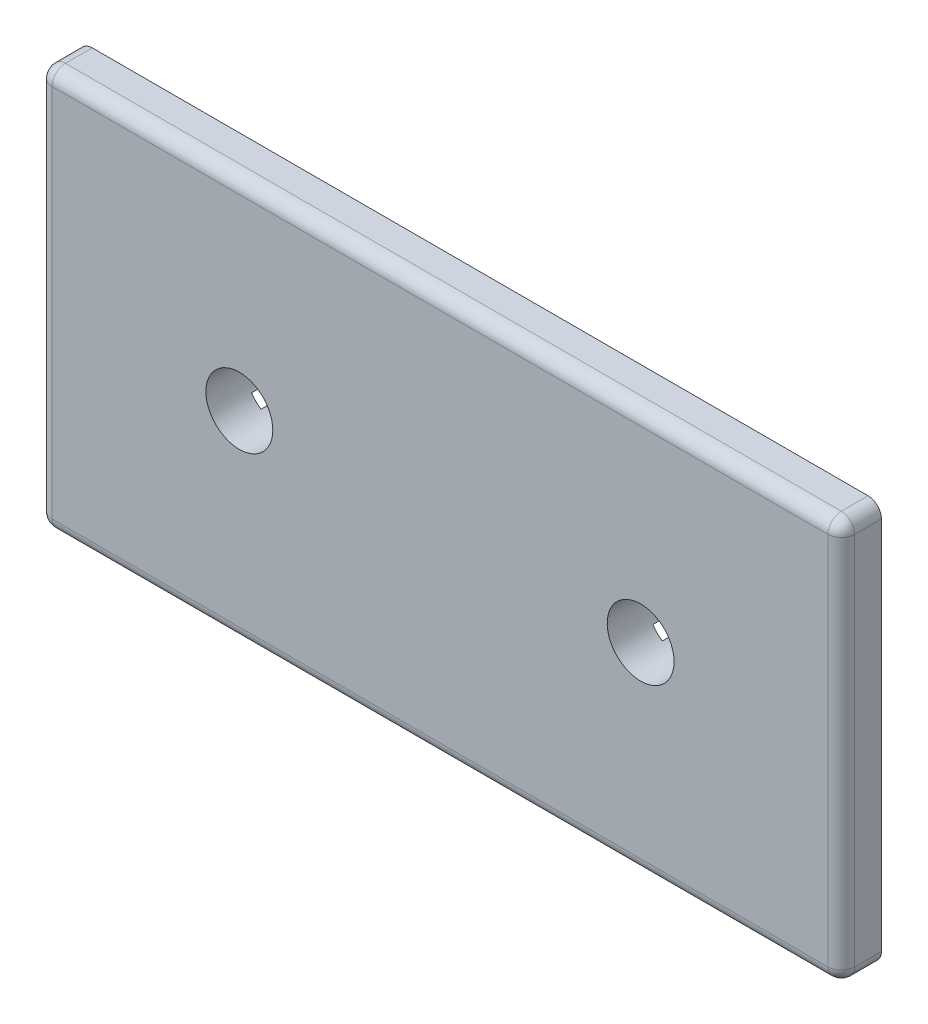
ISO-10303-21;
HEADER;
FILE_DESCRIPTION(('STEP AP214'),'2;1');
FILE_NAME('part.step','',(''),(''),'','','');
FILE_SCHEMA(('AUTOMOTIVE_DESIGN { 1 0 10303 214 1 1 1 1 }'));
ENDSEC;
DATA;
#1=APPLICATION_CONTEXT('core data for automotive mechanical design processes');
#2=APPLICATION_PROTOCOL_DEFINITION('international standard','automotive_design',2000,#1);
#3=PRODUCT_CONTEXT('',#1,'mechanical');
#4=PRODUCT('Part','Part','',(#3));
#5=PRODUCT_RELATED_PRODUCT_CATEGORY('part','',(#4));
#6=PRODUCT_DEFINITION_FORMATION('','',#4);
#7=PRODUCT_DEFINITION_CONTEXT('part definition',#1,'design');
#8=PRODUCT_DEFINITION('design','',#6,#7);
#9=PRODUCT_DEFINITION_SHAPE('','',#8);
#10=(LENGTH_UNIT() NAMED_UNIT(*) SI_UNIT(.MILLI.,.METRE.));
#11=(NAMED_UNIT(*) PLANE_ANGLE_UNIT() SI_UNIT($,.RADIAN.));
#12=(NAMED_UNIT(*) SI_UNIT($,.STERADIAN.) SOLID_ANGLE_UNIT());
#13=UNCERTAINTY_MEASURE_WITH_UNIT(LENGTH_MEASURE(1.E-05),#10,'distance_accuracy_value','');
#14=(GEOMETRIC_REPRESENTATION_CONTEXT(3) GLOBAL_UNCERTAINTY_ASSIGNED_CONTEXT((#13)) GLOBAL_UNIT_ASSIGNED_CONTEXT((#10,
#11,#12)) REPRESENTATION_CONTEXT('',''));
#15=CARTESIAN_POINT('',(0.,0.,0.));
#16=DIRECTION('',(0.,0.,1.));
#17=DIRECTION('',(1.,0.,0.));
#18=AXIS2_PLACEMENT_3D('',#15,#16,#17);
#19=CARTESIAN_POINT('',(0.,0.,1.));
#20=DIRECTION('',(0.,0.,1.));
#21=DIRECTION('',(1.,0.,0.));
#22=AXIS2_PLACEMENT_3D('',#19,#20,#21);
#23=PLANE('',#22);
#24=CARTESIAN_POINT('',(15.,0.,1.));
#25=DIRECTION('',(0.,0.,-1.));
#26=DIRECTION('',(-1.,0.,0.));
#27=AXIS2_PLACEMENT_3D('',#24,#25,#26);
#28=CIRCLE('',#27,4.875);
#29=CARTESIAN_POINT('',(10.125,0.,1.));
#30=VERTEX_POINT('',#29);
#31=EDGE_CURVE('E32',#30,#30,#28,.T.);
#32=ORIENTED_EDGE('',*,*,#31,.F.);
#33=EDGE_LOOP('',(#32));
#34=FACE_BOUND('',#33,.T.);
#35=CARTESIAN_POINT('',(-15.,0.,1.));
#36=DIRECTION('',(0.,0.,-1.));
#37=DIRECTION('',(-1.,0.,0.));
#38=AXIS2_PLACEMENT_3D('',#35,#36,#37);
#39=CIRCLE('',#38,4.875);
#40=CARTESIAN_POINT('',(-19.875,0.,1.));
#41=VERTEX_POINT('',#40);
#42=EDGE_CURVE('E514',#41,#41,#39,.T.);
#43=ORIENTED_EDGE('',*,*,#42,.F.);
#44=EDGE_LOOP('',(#43));
#45=FACE_BOUND('',#44,.T.);
#46=DIRECTION('',(0.,1.,0.));
#47=VECTOR('',#46,1.);
#48=CARTESIAN_POINT('',(-29.,-13.,1.));
#49=LINE('',#48,#47);
#50=CARTESIAN_POINT('',(-29.,-13.,1.));
#51=VERTEX_POINT('',#50);
#52=CARTESIAN_POINT('',(-29.,13.,1.));
#53=VERTEX_POINT('',#52);
#54=EDGE_CURVE('E71',#51,#53,#49,.T.);
#55=ORIENTED_EDGE('',*,*,#54,.T.);
#56=CARTESIAN_POINT('',(-28.,13.,1.));
#57=DIRECTION('',(0.,0.,1.));
#58=DIRECTION('',(1.,0.,0.));
#59=AXIS2_PLACEMENT_3D('',#56,#57,#58);
#60=CIRCLE('',#59,0.999999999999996);
#61=CARTESIAN_POINT('',(-28.,14.,1.));
#62=VERTEX_POINT('',#61);
#63=EDGE_CURVE('E66',#53,#62,#60,.F.);
#64=ORIENTED_EDGE('',*,*,#63,.T.);
#65=DIRECTION('',(1.,0.,0.));
#66=VECTOR('',#65,1.);
#67=CARTESIAN_POINT('',(-28.,14.,1.));
#68=LINE('',#67,#66);
#69=CARTESIAN_POINT('',(28.,14.,1.));
#70=VERTEX_POINT('',#69);
#71=EDGE_CURVE('E69',#62,#70,#68,.T.);
#72=ORIENTED_EDGE('',*,*,#71,.T.);
#73=CARTESIAN_POINT('',(28.,13.,1.));
#74=DIRECTION('',(0.,0.,1.));
#75=DIRECTION('',(1.,0.,0.));
#76=AXIS2_PLACEMENT_3D('',#73,#74,#75);
#77=CIRCLE('',#76,1.00000000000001);
#78=CARTESIAN_POINT('',(29.,13.,1.));
#79=VERTEX_POINT('',#78);
#80=EDGE_CURVE('E93',#70,#79,#77,.F.);
#81=ORIENTED_EDGE('',*,*,#80,.T.);
#82=DIRECTION('',(0.,1.,0.));
#83=VECTOR('',#82,1.);
#84=CARTESIAN_POINT('',(29.,13.,1.));
#85=LINE('',#84,#83);
#86=CARTESIAN_POINT('',(29.,-13.,1.));
#87=VERTEX_POINT('',#86);
#88=EDGE_CURVE('E96',#79,#87,#85,.F.);
#89=ORIENTED_EDGE('',*,*,#88,.T.);
#90=CARTESIAN_POINT('',(28.,-13.,1.));
#91=DIRECTION('',(0.,0.,1.));
#92=DIRECTION('',(1.,0.,0.));
#93=AXIS2_PLACEMENT_3D('',#90,#91,#92);
#94=CIRCLE('',#93,1.00000000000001);
#95=CARTESIAN_POINT('',(28.,-14.,1.));
#96=VERTEX_POINT('',#95);
#97=EDGE_CURVE('E51',#87,#96,#94,.F.);
#98=ORIENTED_EDGE('',*,*,#97,.T.);
#99=DIRECTION('',(1.,0.,0.));
#100=VECTOR('',#99,1.);
#101=CARTESIAN_POINT('',(28.,-14.,1.));
#102=LINE('',#101,#100);
#103=CARTESIAN_POINT('',(-28.,-14.,1.));
#104=VERTEX_POINT('',#103);
#105=EDGE_CURVE('E502',#96,#104,#102,.F.);
#106=ORIENTED_EDGE('',*,*,#105,.T.);
#107=CARTESIAN_POINT('',(-28.,-13.,1.));
#108=DIRECTION('',(0.,0.,1.));
#109=DIRECTION('',(1.,0.,0.));
#110=AXIS2_PLACEMENT_3D('',#107,#108,#109);
#111=CIRCLE('',#110,1.00000000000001);
#112=EDGE_CURVE('E19',#51,#104,#111,.T.);
#113=ORIENTED_EDGE('',*,*,#112,.F.);
#114=EDGE_LOOP('',(#55,#64,#72,#81,#89,#98,#106,#113));
#115=FACE_BOUND('',#114,.T.);
#116=ADVANCED_FACE('F15',(#34,#45,#115),#23,.F.);
#117=CARTESIAN_POINT('',(15.,0.,1.));
#118=DIRECTION('',(0.,0.,-1.));
#119=DIRECTION('',(-1.,0.,0.));
#120=AXIS2_PLACEMENT_3D('',#117,#118,#119);
#121=CYLINDRICAL_SURFACE('',#120,4.875);
#122=ORIENTED_EDGE('',*,*,#31,.T.);
#123=EDGE_LOOP('',(#122));
#124=FACE_BOUND('',#123,.T.);
#125=CARTESIAN_POINT('',(15.,0.,0.));
#126=DIRECTION('',(0.,0.,-1.));
#127=DIRECTION('',(-1.,0.,0.));
#128=AXIS2_PLACEMENT_3D('',#125,#126,#127);
#129=CIRCLE('',#128,4.875);
#130=CARTESIAN_POINT('',(18.075413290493,3.78252007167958,0.));
#131=VERTEX_POINT('',#130);
#132=EDGE_CURVE('E488',#131,#131,#129,.F.);
#133=ORIENTED_EDGE('',*,*,#132,.T.);
#134=EDGE_LOOP('',(#133));
#135=FACE_BOUND('',#134,.T.);
#136=ADVANCED_FACE('F620',(#124,#135),#121,.T.);
#137=CARTESIAN_POINT('',(-15.,0.,1.));
#138=DIRECTION('',(0.,0.,-1.));
#139=DIRECTION('',(-1.,0.,0.));
#140=AXIS2_PLACEMENT_3D('',#137,#138,#139);
#141=CYLINDRICAL_SURFACE('',#140,4.875);
#142=ORIENTED_EDGE('',*,*,#42,.T.);
#143=EDGE_LOOP('',(#142));
#144=FACE_BOUND('',#143,.T.);
#145=CARTESIAN_POINT('',(-15.,0.,0.));
#146=DIRECTION('',(0.,0.,-1.));
#147=DIRECTION('',(-1.,0.,0.));
#148=AXIS2_PLACEMENT_3D('',#145,#146,#147);
#149=CIRCLE('',#148,4.875);
#150=CARTESIAN_POINT('',(-18.7825200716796,3.07541329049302,0.));
#151=VERTEX_POINT('',#150);
#152=EDGE_CURVE('E462',#151,#151,#149,.F.);
#153=ORIENTED_EDGE('',*,*,#152,.T.);
#154=EDGE_LOOP('',(#153));
#155=FACE_BOUND('',#154,.T.);
#156=ADVANCED_FACE('F623',(#144,#155),#141,.T.);
#157=CARTESIAN_POINT('',(-29.,-13.,0.));
#158=DIRECTION('',(-1.,0.,0.));
#159=DIRECTION('',(0.,0.,1.));
#160=AXIS2_PLACEMENT_3D('',#157,#158,#159);
#161=PLANE('',#160);
#162=DIRECTION('',(0.,0.,1.));
#163=VECTOR('',#162,1.);
#164=CARTESIAN_POINT('',(-29.,-13.,0.));
#165=LINE('',#164,#163);
#166=CARTESIAN_POINT('',(-29.,-13.,0.));
#167=VERTEX_POINT('',#166);
#168=EDGE_CURVE('E498',#51,#167,#165,.F.);
#169=ORIENTED_EDGE('',*,*,#168,.T.);
#170=DIRECTION('',(0.,1.,0.));
#171=VECTOR('',#170,1.);
#172=CARTESIAN_POINT('',(-29.,0.,0.));
#173=LINE('',#172,#171);
#174=CARTESIAN_POINT('',(-29.,13.,0.));
#175=VERTEX_POINT('',#174);
#176=EDGE_CURVE('E565',#167,#175,#173,.T.);
#177=ORIENTED_EDGE('',*,*,#176,.T.);
#178=DIRECTION('',(0.,0.,1.));
#179=VECTOR('',#178,1.);
#180=CARTESIAN_POINT('',(-29.,13.,0.));
#181=LINE('',#180,#179);
#182=EDGE_CURVE('E76',#175,#53,#181,.T.);
#183=ORIENTED_EDGE('',*,*,#182,.T.);
#184=ORIENTED_EDGE('',*,*,#54,.F.);
#185=EDGE_LOOP('',(#169,#177,#183,#184));
#186=FACE_BOUND('',#185,.T.);
#187=ADVANCED_FACE('F627',(#186),#161,.F.);
#188=CARTESIAN_POINT('',(-28.,13.,0.));
#189=DIRECTION('',(0.,0.,1.));
#190=DIRECTION('',(1.,0.,0.));
#191=AXIS2_PLACEMENT_3D('',#188,#189,#190);
#192=CYLINDRICAL_SURFACE('',#191,0.999999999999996);
#193=ORIENTED_EDGE('',*,*,#182,.F.);
#194=CARTESIAN_POINT('',(-28.,13.,0.));
#195=DIRECTION('',(0.,0.,1.));
#196=DIRECTION('',(1.,0.,0.));
#197=AXIS2_PLACEMENT_3D('',#194,#195,#196);
#198=CIRCLE('',#197,0.999999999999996);
#199=CARTESIAN_POINT('',(-28.,14.,0.));
#200=VERTEX_POINT('',#199);
#201=EDGE_CURVE('E83',#175,#200,#198,.F.);
#202=ORIENTED_EDGE('',*,*,#201,.T.);
#203=DIRECTION('',(0.,0.,1.));
#204=VECTOR('',#203,1.);
#205=CARTESIAN_POINT('',(-28.,14.,0.));
#206=LINE('',#205,#204);
#207=EDGE_CURVE('E75',#200,#62,#206,.T.);
#208=ORIENTED_EDGE('',*,*,#207,.T.);
#209=ORIENTED_EDGE('',*,*,#63,.F.);
#210=EDGE_LOOP('',(#193,#202,#208,#209));
#211=FACE_BOUND('',#210,.T.);
#212=ADVANCED_FACE('F80',(#211),#192,.F.);
#213=CARTESIAN_POINT('',(-28.,14.,0.));
#214=DIRECTION('',(0.,1.,0.));
#215=DIRECTION('',(0.,0.,1.));
#216=AXIS2_PLACEMENT_3D('',#213,#214,#215);
#217=PLANE('',#216);
#218=ORIENTED_EDGE('',*,*,#207,.F.);
#219=DIRECTION('',(1.,0.,0.));
#220=VECTOR('',#219,1.);
#221=CARTESIAN_POINT('',(0.,14.,0.));
#222=LINE('',#221,#220);
#223=CARTESIAN_POINT('',(28.,14.,0.));
#224=VERTEX_POINT('',#223);
#225=EDGE_CURVE('E567',#200,#224,#222,.T.);
#226=ORIENTED_EDGE('',*,*,#225,.T.);
#227=DIRECTION('',(0.,0.,1.));
#228=VECTOR('',#227,1.);
#229=CARTESIAN_POINT('',(28.,14.,0.));
#230=LINE('',#229,#228);
#231=EDGE_CURVE('E90',#224,#70,#230,.T.);
#232=ORIENTED_EDGE('',*,*,#231,.T.);
#233=ORIENTED_EDGE('',*,*,#71,.F.);
#234=EDGE_LOOP('',(#218,#226,#232,#233));
#235=FACE_BOUND('',#234,.T.);
#236=ADVANCED_FACE('F88',(#235),#217,.F.);
#237=CARTESIAN_POINT('',(28.,13.,0.));
#238=DIRECTION('',(0.,0.,1.));
#239=DIRECTION('',(1.,0.,0.));
#240=AXIS2_PLACEMENT_3D('',#237,#238,#239);
#241=CYLINDRICAL_SURFACE('',#240,1.00000000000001);
#242=ORIENTED_EDGE('',*,*,#231,.F.);
#243=CARTESIAN_POINT('',(28.,13.,0.));
#244=DIRECTION('',(0.,0.,1.));
#245=DIRECTION('',(1.,0.,0.));
#246=AXIS2_PLACEMENT_3D('',#243,#244,#245);
#247=CIRCLE('',#246,1.00000000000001);
#248=CARTESIAN_POINT('',(29.,13.,0.));
#249=VERTEX_POINT('',#248);
#250=EDGE_CURVE('E568',#224,#249,#247,.F.);
#251=ORIENTED_EDGE('',*,*,#250,.T.);
#252=DIRECTION('',(0.,0.,-1.));
#253=VECTOR('',#252,1.);
#254=CARTESIAN_POINT('',(29.,13.,0.));
#255=LINE('',#254,#253);
#256=EDGE_CURVE('E510',#249,#79,#255,.F.);
#257=ORIENTED_EDGE('',*,*,#256,.T.);
#258=ORIENTED_EDGE('',*,*,#80,.F.);
#259=EDGE_LOOP('',(#242,#251,#257,#258));
#260=FACE_BOUND('',#259,.T.);
#261=ADVANCED_FACE('F635',(#260),#241,.F.);
#262=CARTESIAN_POINT('',(29.,13.,0.));
#263=DIRECTION('',(1.,0.,0.));
#264=DIRECTION('',(0.,0.,-1.));
#265=AXIS2_PLACEMENT_3D('',#262,#263,#264);
#266=PLANE('',#265);
#267=ORIENTED_EDGE('',*,*,#256,.F.);
#268=DIRECTION('',(0.,1.,0.));
#269=VECTOR('',#268,1.);
#270=CARTESIAN_POINT('',(29.,0.,0.));
#271=LINE('',#270,#269);
#272=CARTESIAN_POINT('',(29.,-13.,0.));
#273=VERTEX_POINT('',#272);
#274=EDGE_CURVE('E571',#249,#273,#271,.F.);
#275=ORIENTED_EDGE('',*,*,#274,.T.);
#276=DIRECTION('',(0.,0.,1.));
#277=VECTOR('',#276,1.);
#278=CARTESIAN_POINT('',(29.,-13.,0.));
#279=LINE('',#278,#277);
#280=EDGE_CURVE('E507',#273,#87,#279,.T.);
#281=ORIENTED_EDGE('',*,*,#280,.T.);
#282=ORIENTED_EDGE('',*,*,#88,.F.);
#283=EDGE_LOOP('',(#267,#275,#281,#282));
#284=FACE_BOUND('',#283,.T.);
#285=ADVANCED_FACE('F638',(#284),#266,.F.);
#286=CARTESIAN_POINT('',(28.,-13.,0.));
#287=DIRECTION('',(0.,0.,1.));
#288=DIRECTION('',(1.,0.,0.));
#289=AXIS2_PLACEMENT_3D('',#286,#287,#288);
#290=CYLINDRICAL_SURFACE('',#289,1.00000000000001);
#291=ORIENTED_EDGE('',*,*,#280,.F.);
#292=CARTESIAN_POINT('',(28.,-13.,0.));
#293=DIRECTION('',(0.,0.,1.));
#294=DIRECTION('',(1.,0.,0.));
#295=AXIS2_PLACEMENT_3D('',#292,#293,#294);
#296=CIRCLE('',#295,1.00000000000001);
#297=CARTESIAN_POINT('',(28.,-14.,0.));
#298=VERTEX_POINT('',#297);
#299=EDGE_CURVE('E572',#273,#298,#296,.F.);
#300=ORIENTED_EDGE('',*,*,#299,.T.);
#301=DIRECTION('',(0.,0.,-1.));
#302=VECTOR('',#301,1.);
#303=CARTESIAN_POINT('',(28.,-14.,0.));
#304=LINE('',#303,#302);
#305=EDGE_CURVE('E505',#298,#96,#304,.F.);
#306=ORIENTED_EDGE('',*,*,#305,.T.);
#307=ORIENTED_EDGE('',*,*,#97,.F.);
#308=EDGE_LOOP('',(#291,#300,#306,#307));
#309=FACE_BOUND('',#308,.T.);
#310=ADVANCED_FACE('F642',(#309),#290,.F.);
#311=CARTESIAN_POINT('',(28.,-14.,0.));
#312=DIRECTION('',(0.,-1.,0.));
#313=DIRECTION('',(0.,0.,-1.));
#314=AXIS2_PLACEMENT_3D('',#311,#312,#313);
#315=PLANE('',#314);
#316=ORIENTED_EDGE('',*,*,#305,.F.);
#317=DIRECTION('',(1.,0.,0.));
#318=VECTOR('',#317,1.);
#319=CARTESIAN_POINT('',(0.,-14.,0.));
#320=LINE('',#319,#318);
#321=CARTESIAN_POINT('',(-28.,-14.,0.));
#322=VERTEX_POINT('',#321);
#323=EDGE_CURVE('E575',#298,#322,#320,.F.);
#324=ORIENTED_EDGE('',*,*,#323,.T.);
#325=DIRECTION('',(0.,0.,1.));
#326=VECTOR('',#325,1.);
#327=CARTESIAN_POINT('',(-28.,-14.,0.));
#328=LINE('',#327,#326);
#329=EDGE_CURVE('E501',#322,#104,#328,.T.);
#330=ORIENTED_EDGE('',*,*,#329,.T.);
#331=ORIENTED_EDGE('',*,*,#105,.F.);
#332=EDGE_LOOP('',(#316,#324,#330,#331));
#333=FACE_BOUND('',#332,.T.);
#334=ADVANCED_FACE('F646',(#333),#315,.F.);
#335=CARTESIAN_POINT('',(-28.,-13.,0.));
#336=DIRECTION('',(0.,0.,1.));
#337=DIRECTION('',(1.,0.,0.));
#338=AXIS2_PLACEMENT_3D('',#335,#336,#337);
#339=CYLINDRICAL_SURFACE('',#338,1.00000000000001);
#340=ORIENTED_EDGE('',*,*,#329,.F.);
#341=CARTESIAN_POINT('',(-28.,-13.,0.));
#342=DIRECTION('',(0.,0.,1.));
#343=DIRECTION('',(1.,0.,0.));
#344=AXIS2_PLACEMENT_3D('',#341,#342,#343);
#345=CIRCLE('',#344,1.00000000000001);
#346=EDGE_CURVE('E576',#322,#167,#345,.F.);
#347=ORIENTED_EDGE('',*,*,#346,.T.);
#348=ORIENTED_EDGE('',*,*,#168,.F.);
#349=ORIENTED_EDGE('',*,*,#112,.T.);
#350=EDGE_LOOP('',(#340,#347,#348,#349));
#351=FACE_BOUND('',#350,.T.);
#352=ADVANCED_FACE('F650',(#351),#339,.F.);
#353=CARTESIAN_POINT('',(15.,0.,0.));
#354=DIRECTION('',(0.,0.,1.));
#355=DIRECTION('',(1.,0.,0.));
#356=AXIS2_PLACEMENT_3D('',#353,#354,#355);
#357=PLANE('',#356);
#358=DIRECTION('',(-0.707106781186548,0.707106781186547,0.));
#359=VECTOR('',#358,1.);
#360=CARTESIAN_POINT('',(13.6215025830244,2.08560419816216,0.));
#361=LINE('',#360,#359);
#362=CARTESIAN_POINT('',(13.6215025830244,2.08560419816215,0.));
#363=VERTEX_POINT('',#362);
#364=CARTESIAN_POINT('',(12.7255788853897,2.98152789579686,0.));
#365=VERTEX_POINT('',#364);
#366=EDGE_CURVE('E459',#363,#365,#361,.T.);
#367=ORIENTED_EDGE('',*,*,#366,.F.);
#368=CARTESIAN_POINT('',(15.,0.,0.));
#369=DIRECTION('',(0.,0.,-1.));
#370=DIRECTION('',(-1.,0.,0.));
#371=AXIS2_PLACEMENT_3D('',#368,#369,#370);
#372=CIRCLE('',#371,2.5);
#373=CARTESIAN_POINT('',(12.9143958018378,1.3784974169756,0.));
#374=VERTEX_POINT('',#373);
#375=EDGE_CURVE('E463',#374,#363,#372,.T.);
#376=ORIENTED_EDGE('',*,*,#375,.F.);
#377=DIRECTION('',(0.707106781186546,-0.707106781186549,0.));
#378=VECTOR('',#377,1.);
#379=CARTESIAN_POINT('',(12.0184721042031,2.2744211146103,0.));
#380=LINE('',#379,#378);
#381=CARTESIAN_POINT('',(12.0184721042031,2.2744211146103,0.));
#382=VERTEX_POINT('',#381);
#383=EDGE_CURVE('E464',#382,#374,#380,.T.);
#384=ORIENTED_EDGE('',*,*,#383,.F.);
#385=CARTESIAN_POINT('',(15.,0.,0.));
#386=DIRECTION('',(0.,0.,-1.));
#387=DIRECTION('',(-1.,0.,0.));
#388=AXIS2_PLACEMENT_3D('',#385,#386,#387);
#389=CIRCLE('',#388,3.75);
#390=CARTESIAN_POINT('',(12.0184721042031,-2.2744211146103,0.));
#391=VERTEX_POINT('',#390);
#392=EDGE_CURVE('E852',#391,#382,#389,.T.);
#393=ORIENTED_EDGE('',*,*,#392,.F.);
#394=DIRECTION('',(-0.707106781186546,-0.707106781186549,0.));
#395=VECTOR('',#394,1.);
#396=CARTESIAN_POINT('',(12.9143958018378,-1.3784974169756,0.));
#397=LINE('',#396,#395);
#398=CARTESIAN_POINT('',(12.9143958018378,-1.3784974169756,0.));
#399=VERTEX_POINT('',#398);
#400=EDGE_CURVE('E467',#399,#391,#397,.T.);
#401=ORIENTED_EDGE('',*,*,#400,.F.);
#402=CARTESIAN_POINT('',(15.,0.,0.));
#403=DIRECTION('',(0.,0.,-1.));
#404=DIRECTION('',(-1.,0.,0.));
#405=AXIS2_PLACEMENT_3D('',#402,#403,#404);
#406=CIRCLE('',#405,2.5);
#407=CARTESIAN_POINT('',(13.6215025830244,-2.08560419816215,0.));
#408=VERTEX_POINT('',#407);
#409=EDGE_CURVE('E470',#408,#399,#406,.T.);
#410=ORIENTED_EDGE('',*,*,#409,.F.);
#411=DIRECTION('',(0.707106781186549,0.707106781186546,0.));
#412=VECTOR('',#411,1.);
#413=CARTESIAN_POINT('',(12.7255788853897,-2.98152789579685,0.));
#414=LINE('',#413,#412);
#415=CARTESIAN_POINT('',(12.7255788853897,-2.98152789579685,0.));
#416=VERTEX_POINT('',#415);
#417=EDGE_CURVE('E471',#416,#408,#414,.T.);
#418=ORIENTED_EDGE('',*,*,#417,.F.);
#419=CARTESIAN_POINT('',(15.,0.,0.));
#420=DIRECTION('',(0.,0.,-1.));
#421=DIRECTION('',(-1.,0.,0.));
#422=AXIS2_PLACEMENT_3D('',#419,#420,#421);
#423=CIRCLE('',#422,3.75);
#424=CARTESIAN_POINT('',(17.2744211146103,-2.98152789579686,0.));
#425=VERTEX_POINT('',#424);
#426=EDGE_CURVE('E844',#425,#416,#423,.T.);
#427=ORIENTED_EDGE('',*,*,#426,.F.);
#428=DIRECTION('',(0.707106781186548,-0.707106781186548,0.));
#429=VECTOR('',#428,1.);
#430=CARTESIAN_POINT('',(16.3784974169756,-2.08560419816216,0.));
#431=LINE('',#430,#429);
#432=CARTESIAN_POINT('',(16.3784974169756,-2.08560419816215,0.));
#433=VERTEX_POINT('',#432);
#434=EDGE_CURVE('E474',#433,#425,#431,.T.);
#435=ORIENTED_EDGE('',*,*,#434,.F.);
#436=CARTESIAN_POINT('',(15.,0.,0.));
#437=DIRECTION('',(0.,0.,-1.));
#438=DIRECTION('',(-1.,0.,0.));
#439=AXIS2_PLACEMENT_3D('',#436,#437,#438);
#440=CIRCLE('',#439,2.5);
#441=CARTESIAN_POINT('',(17.0856041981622,-1.3784974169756,0.));
#442=VERTEX_POINT('',#441);
#443=EDGE_CURVE('E477',#442,#433,#440,.T.);
#444=ORIENTED_EDGE('',*,*,#443,.F.);
#445=DIRECTION('',(-0.707106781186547,0.707106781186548,0.));
#446=VECTOR('',#445,1.);
#447=CARTESIAN_POINT('',(17.9815278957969,-2.27442111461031,0.));
#448=LINE('',#447,#446);
#449=CARTESIAN_POINT('',(17.9815278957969,-2.27442111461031,0.));
#450=VERTEX_POINT('',#449);
#451=EDGE_CURVE('E478',#450,#442,#448,.T.);
#452=ORIENTED_EDGE('',*,*,#451,.F.);
#453=CARTESIAN_POINT('',(15.,0.,0.));
#454=DIRECTION('',(0.,0.,-1.));
#455=DIRECTION('',(-1.,0.,0.));
#456=AXIS2_PLACEMENT_3D('',#453,#454,#455);
#457=CIRCLE('',#456,3.75);
#458=CARTESIAN_POINT('',(17.9815278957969,2.2744211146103,0.));
#459=VERTEX_POINT('',#458);
#460=EDGE_CURVE('E837',#459,#450,#457,.T.);
#461=ORIENTED_EDGE('',*,*,#460,.F.);
#462=DIRECTION('',(0.707106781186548,0.707106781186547,0.));
#463=VECTOR('',#462,1.);
#464=CARTESIAN_POINT('',(17.0856041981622,1.3784974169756,0.));
#465=LINE('',#464,#463);
#466=CARTESIAN_POINT('',(17.0856041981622,1.3784974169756,0.));
#467=VERTEX_POINT('',#466);
#468=EDGE_CURVE('E481',#467,#459,#465,.T.);
#469=ORIENTED_EDGE('',*,*,#468,.F.);
#470=CARTESIAN_POINT('',(15.,0.,0.));
#471=DIRECTION('',(0.,0.,-1.));
#472=DIRECTION('',(-1.,0.,0.));
#473=AXIS2_PLACEMENT_3D('',#470,#471,#472);
#474=CIRCLE('',#473,2.5);
#475=CARTESIAN_POINT('',(16.3784974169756,2.08560419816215,0.));
#476=VERTEX_POINT('',#475);
#477=EDGE_CURVE('E484',#476,#467,#474,.T.);
#478=ORIENTED_EDGE('',*,*,#477,.F.);
#479=DIRECTION('',(-0.707106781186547,-0.707106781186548,0.));
#480=VECTOR('',#479,1.);
#481=CARTESIAN_POINT('',(17.2744211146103,2.98152789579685,0.));
#482=LINE('',#481,#480);
#483=CARTESIAN_POINT('',(17.2744211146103,2.98152789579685,0.));
#484=VERTEX_POINT('',#483);
#485=EDGE_CURVE('E485',#484,#476,#482,.T.);
#486=ORIENTED_EDGE('',*,*,#485,.F.);
#487=CARTESIAN_POINT('',(15.,0.,0.));
#488=DIRECTION('',(0.,0.,-1.));
#489=DIRECTION('',(-1.,0.,0.));
#490=AXIS2_PLACEMENT_3D('',#487,#488,#489);
#491=CIRCLE('',#490,3.75);
#492=EDGE_CURVE('E588',#365,#484,#491,.T.);
#493=ORIENTED_EDGE('',*,*,#492,.F.);
#494=EDGE_LOOP('',(#367,#376,#384,#393,#401,#410,#418,#427,#435,#444,#452,#461,#469,#478,#486,#493));
#495=FACE_BOUND('',#494,.T.);
#496=ORIENTED_EDGE('',*,*,#132,.F.);
#497=EDGE_LOOP('',(#496));
#498=FACE_BOUND('',#497,.T.);
#499=ADVANCED_FACE('F654',(#495,#498),#357,.F.);
#500=CARTESIAN_POINT('',(-15.,0.,0.));
#501=DIRECTION('',(0.,0.,1.));
#502=DIRECTION('',(1.,0.,0.));
#503=AXIS2_PLACEMENT_3D('',#500,#501,#502);
#504=PLANE('',#503);
#505=DIRECTION('',(-0.707106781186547,-0.707106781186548,0.));
#506=VECTOR('',#505,1.);
#507=CARTESIAN_POINT('',(-17.0856041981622,-1.3784974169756,0.));
#508=LINE('',#507,#506);
#509=CARTESIAN_POINT('',(-17.0856041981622,-1.3784974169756,0.));
#510=VERTEX_POINT('',#509);
#511=CARTESIAN_POINT('',(-17.9815278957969,-2.27442111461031,0.));
#512=VERTEX_POINT('',#511);
#513=EDGE_CURVE('E550',#510,#512,#508,.T.);
#514=ORIENTED_EDGE('',*,*,#513,.F.);
#515=CARTESIAN_POINT('',(-15.,0.,0.));
#516=DIRECTION('',(0.,0.,-1.));
#517=DIRECTION('',(-1.,0.,0.));
#518=AXIS2_PLACEMENT_3D('',#515,#516,#517);
#519=CIRCLE('',#518,2.5);
#520=CARTESIAN_POINT('',(-16.3784974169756,-2.08560419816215,0.));
#521=VERTEX_POINT('',#520);
#522=EDGE_CURVE('E547',#521,#510,#519,.T.);
#523=ORIENTED_EDGE('',*,*,#522,.F.);
#524=DIRECTION('',(0.707106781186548,0.707106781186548,0.));
#525=VECTOR('',#524,1.);
#526=CARTESIAN_POINT('',(-17.2744211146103,-2.98152789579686,0.));
#527=LINE('',#526,#525);
#528=CARTESIAN_POINT('',(-17.2744211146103,-2.98152789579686,0.));
#529=VERTEX_POINT('',#528);
#530=EDGE_CURVE('E551',#529,#521,#527,.T.);
#531=ORIENTED_EDGE('',*,*,#530,.F.);
#532=CARTESIAN_POINT('',(-15.,0.,0.));
#533=DIRECTION('',(0.,0.,-1.));
#534=DIRECTION('',(-1.,0.,0.));
#535=AXIS2_PLACEMENT_3D('',#532,#533,#534);
#536=CIRCLE('',#535,3.75);
#537=CARTESIAN_POINT('',(-12.7255788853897,-2.98152789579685,0.));
#538=VERTEX_POINT('',#537);
#539=EDGE_CURVE('E830',#538,#529,#536,.T.);
#540=ORIENTED_EDGE('',*,*,#539,.F.);
#541=DIRECTION('',(0.707106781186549,-0.707106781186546,0.));
#542=VECTOR('',#541,1.);
#543=CARTESIAN_POINT('',(-13.6215025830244,-2.08560419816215,0.));
#544=LINE('',#543,#542);
#545=CARTESIAN_POINT('',(-13.6215025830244,-2.08560419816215,0.));
#546=VERTEX_POINT('',#545);
#547=EDGE_CURVE('E545',#546,#538,#544,.T.);
#548=ORIENTED_EDGE('',*,*,#547,.F.);
#549=CARTESIAN_POINT('',(-15.,0.,0.));
#550=DIRECTION('',(0.,0.,-1.));
#551=DIRECTION('',(-1.,0.,0.));
#552=AXIS2_PLACEMENT_3D('',#549,#550,#551);
#553=CIRCLE('',#552,2.5);
#554=CARTESIAN_POINT('',(-12.9143958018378,-1.3784974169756,0.));
#555=VERTEX_POINT('',#554);
#556=EDGE_CURVE('E542',#555,#546,#553,.T.);
#557=ORIENTED_EDGE('',*,*,#556,.F.);
#558=DIRECTION('',(-0.707106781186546,0.707106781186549,0.));
#559=VECTOR('',#558,1.);
#560=CARTESIAN_POINT('',(-12.0184721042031,-2.2744211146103,0.));
#561=LINE('',#560,#559);
#562=CARTESIAN_POINT('',(-12.0184721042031,-2.2744211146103,0.));
#563=VERTEX_POINT('',#562);
#564=EDGE_CURVE('E546',#563,#555,#561,.T.);
#565=ORIENTED_EDGE('',*,*,#564,.F.);
#566=CARTESIAN_POINT('',(-15.,0.,0.));
#567=DIRECTION('',(0.,0.,-1.));
#568=DIRECTION('',(-1.,0.,0.));
#569=AXIS2_PLACEMENT_3D('',#566,#567,#568);
#570=CIRCLE('',#569,3.75);
#571=CARTESIAN_POINT('',(-12.0184721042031,2.2744211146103,0.));
#572=VERTEX_POINT('',#571);
#573=EDGE_CURVE('E184',#572,#563,#570,.T.);
#574=ORIENTED_EDGE('',*,*,#573,.F.);
#575=DIRECTION('',(0.707106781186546,0.707106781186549,0.));
#576=VECTOR('',#575,1.);
#577=CARTESIAN_POINT('',(-12.9143958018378,1.3784974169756,0.));
#578=LINE('',#577,#576);
#579=CARTESIAN_POINT('',(-12.9143958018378,1.3784974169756,0.));
#580=VERTEX_POINT('',#579);
#581=EDGE_CURVE('E540',#580,#572,#578,.T.);
#582=ORIENTED_EDGE('',*,*,#581,.F.);
#583=CARTESIAN_POINT('',(-15.,0.,0.));
#584=DIRECTION('',(0.,0.,-1.));
#585=DIRECTION('',(-1.,0.,0.));
#586=AXIS2_PLACEMENT_3D('',#583,#584,#585);
#587=CIRCLE('',#586,2.5);
#588=CARTESIAN_POINT('',(-13.6215025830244,2.08560419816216,0.));
#589=VERTEX_POINT('',#588);
#590=EDGE_CURVE('E537',#589,#580,#587,.T.);
#591=ORIENTED_EDGE('',*,*,#590,.F.);
#592=DIRECTION('',(-0.707106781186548,-0.707106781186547,0.));
#593=VECTOR('',#592,1.);
#594=CARTESIAN_POINT('',(-12.7255788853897,2.98152789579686,0.));
#595=LINE('',#594,#593);
#596=CARTESIAN_POINT('',(-12.7255788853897,2.98152789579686,0.));
#597=VERTEX_POINT('',#596);
#598=EDGE_CURVE('E541',#597,#589,#595,.T.);
#599=ORIENTED_EDGE('',*,*,#598,.F.);
#600=CARTESIAN_POINT('',(-15.,0.,0.));
#601=DIRECTION('',(0.,0.,-1.));
#602=DIRECTION('',(-1.,0.,0.));
#603=AXIS2_PLACEMENT_3D('',#600,#601,#602);
#604=CIRCLE('',#603,3.75);
#605=CARTESIAN_POINT('',(-17.2744211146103,2.98152789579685,0.));
#606=VERTEX_POINT('',#605);
#607=EDGE_CURVE('E181',#606,#597,#604,.T.);
#608=ORIENTED_EDGE('',*,*,#607,.F.);
#609=DIRECTION('',(-0.707106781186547,0.707106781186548,0.));
#610=VECTOR('',#609,1.);
#611=CARTESIAN_POINT('',(-16.3784974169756,2.08560419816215,0.));
#612=LINE('',#611,#610);
#613=CARTESIAN_POINT('',(-16.3784974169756,2.08560419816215,0.));
#614=VERTEX_POINT('',#613);
#615=EDGE_CURVE('E536',#614,#606,#612,.T.);
#616=ORIENTED_EDGE('',*,*,#615,.F.);
#617=CARTESIAN_POINT('',(-15.,0.,0.));
#618=DIRECTION('',(0.,0.,-1.));
#619=DIRECTION('',(-1.,0.,0.));
#620=AXIS2_PLACEMENT_3D('',#617,#618,#619);
#621=CIRCLE('',#620,2.5);
#622=CARTESIAN_POINT('',(-17.0856041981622,1.3784974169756,0.));
#623=VERTEX_POINT('',#622);
#624=EDGE_CURVE('E533',#623,#614,#621,.T.);
#625=ORIENTED_EDGE('',*,*,#624,.F.);
#626=DIRECTION('',(0.707106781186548,-0.707106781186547,0.));
#627=VECTOR('',#626,1.);
#628=CARTESIAN_POINT('',(-17.9815278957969,2.2744211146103,0.));
#629=LINE('',#628,#627);
#630=CARTESIAN_POINT('',(-17.9815278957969,2.2744211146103,0.));
#631=VERTEX_POINT('',#630);
#632=EDGE_CURVE('E445',#631,#623,#629,.T.);
#633=ORIENTED_EDGE('',*,*,#632,.F.);
#634=CARTESIAN_POINT('',(-15.,0.,0.));
#635=DIRECTION('',(0.,0.,-1.));
#636=DIRECTION('',(-1.,0.,0.));
#637=AXIS2_PLACEMENT_3D('',#634,#635,#636);
#638=CIRCLE('',#637,3.75);
#639=EDGE_CURVE('E429',#512,#631,#638,.T.);
#640=ORIENTED_EDGE('',*,*,#639,.F.);
#641=EDGE_LOOP('',(#514,#523,#531,#540,#548,#557,#565,#574,#582,#591,#599,#608,#616,#625,#633,#640));
#642=FACE_BOUND('',#641,.T.);
#643=ORIENTED_EDGE('',*,*,#152,.F.);
#644=EDGE_LOOP('',(#643));
#645=FACE_BOUND('',#644,.T.);
#646=ADVANCED_FACE('F658',(#642,#645),#504,.F.);
#647=CARTESIAN_POINT('',(29.,-14.,0.));
#648=DIRECTION('',(0.,0.,1.));
#649=DIRECTION('',(1.,0.,0.));
#650=AXIS2_PLACEMENT_3D('',#647,#648,#649);
#651=CYLINDRICAL_SURFACE('',#650,1.);
#652=CARTESIAN_POINT('',(29.,-14.,2.));
#653=DIRECTION('',(0.,0.,-1.));
#654=DIRECTION('',(1.,0.,0.));
#655=AXIS2_PLACEMENT_3D('',#652,#653,#654);
#656=CIRCLE('',#655,1.);
#657=CARTESIAN_POINT('',(29.,-15.,2.));
#658=VERTEX_POINT('',#657);
#659=CARTESIAN_POINT('',(30.,-14.,2.));
#660=VERTEX_POINT('',#659);
#661=EDGE_CURVE('E755',#658,#660,#656,.F.);
#662=ORIENTED_EDGE('',*,*,#661,.F.);
#663=DIRECTION('',(0.,0.,-1.));
#664=VECTOR('',#663,1.);
#665=CARTESIAN_POINT('',(29.,-15.,0.));
#666=LINE('',#665,#664);
#667=CARTESIAN_POINT('',(29.,-15.,0.));
#668=VERTEX_POINT('',#667);
#669=EDGE_CURVE('E759',#668,#658,#666,.F.);
#670=ORIENTED_EDGE('',*,*,#669,.F.);
#671=CARTESIAN_POINT('',(29.,-14.,0.));
#672=DIRECTION('',(0.,0.,1.));
#673=DIRECTION('',(1.,0.,0.));
#674=AXIS2_PLACEMENT_3D('',#671,#672,#673);
#675=CIRCLE('',#674,1.);
#676=CARTESIAN_POINT('',(30.,-14.,0.));
#677=VERTEX_POINT('',#676);
#678=EDGE_CURVE('E552',#668,#677,#675,.T.);
#679=ORIENTED_EDGE('',*,*,#678,.T.);
#680=DIRECTION('',(0.,0.,-1.));
#681=VECTOR('',#680,1.);
#682=CARTESIAN_POINT('',(30.,-14.,0.));
#683=LINE('',#682,#681);
#684=EDGE_CURVE('E752',#660,#677,#683,.T.);
#685=ORIENTED_EDGE('',*,*,#684,.F.);
#686=EDGE_LOOP('',(#662,#670,#679,#685));
#687=FACE_BOUND('',#686,.T.);
#688=ADVANCED_FACE('F662',(#687),#651,.T.);
#689=CARTESIAN_POINT('',(29.,14.,0.));
#690=DIRECTION('',(0.,0.,1.));
#691=DIRECTION('',(1.,0.,0.));
#692=AXIS2_PLACEMENT_3D('',#689,#690,#691);
#693=CYLINDRICAL_SURFACE('',#692,1.);
#694=CARTESIAN_POINT('',(29.,14.,2.));
#695=DIRECTION('',(0.,0.,1.));
#696=DIRECTION('',(1.,0.,0.));
#697=AXIS2_PLACEMENT_3D('',#694,#695,#696);
#698=CIRCLE('',#697,1.);
#699=CARTESIAN_POINT('',(30.,14.,2.));
#700=VERTEX_POINT('',#699);
#701=CARTESIAN_POINT('',(29.,15.,2.));
#702=VERTEX_POINT('',#701);
#703=EDGE_CURVE('E710',#700,#702,#698,.T.);
#704=ORIENTED_EDGE('',*,*,#703,.F.);
#705=DIRECTION('',(0.,0.,-1.));
#706=VECTOR('',#705,1.);
#707=CARTESIAN_POINT('',(30.,14.,0.));
#708=LINE('',#707,#706);
#709=CARTESIAN_POINT('',(30.,14.,0.));
#710=VERTEX_POINT('',#709);
#711=EDGE_CURVE('E733',#710,#700,#708,.F.);
#712=ORIENTED_EDGE('',*,*,#711,.F.);
#713=CARTESIAN_POINT('',(29.,14.,0.));
#714=DIRECTION('',(0.,0.,1.));
#715=DIRECTION('',(1.,0.,0.));
#716=AXIS2_PLACEMENT_3D('',#713,#714,#715);
#717=CIRCLE('',#716,1.);
#718=CARTESIAN_POINT('',(29.,15.,0.));
#719=VERTEX_POINT('',#718);
#720=EDGE_CURVE('E555',#710,#719,#717,.T.);
#721=ORIENTED_EDGE('',*,*,#720,.T.);
#722=DIRECTION('',(0.,0.,1.));
#723=VECTOR('',#722,1.);
#724=CARTESIAN_POINT('',(29.,15.,0.));
#725=LINE('',#724,#723);
#726=EDGE_CURVE('E709',#702,#719,#725,.F.);
#727=ORIENTED_EDGE('',*,*,#726,.F.);
#728=EDGE_LOOP('',(#704,#712,#721,#727));
#729=FACE_BOUND('',#728,.T.);
#730=ADVANCED_FACE('F666',(#729),#693,.T.);
#731=CARTESIAN_POINT('',(-29.,-14.,0.));
#732=DIRECTION('',(0.,0.,1.));
#733=DIRECTION('',(1.,0.,0.));
#734=AXIS2_PLACEMENT_3D('',#731,#732,#733);
#735=CYLINDRICAL_SURFACE('',#734,1.);
#736=CARTESIAN_POINT('',(-29.,-14.,2.));
#737=DIRECTION('',(0.,0.,1.));
#738=DIRECTION('',(1.,0.,0.));
#739=AXIS2_PLACEMENT_3D('',#736,#737,#738);
#740=CIRCLE('',#739,1.);
#741=CARTESIAN_POINT('',(-29.,-15.,2.00000000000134));
#742=VERTEX_POINT('',#741);
#743=CARTESIAN_POINT('',(-30.,-14.,2.));
#744=VERTEX_POINT('',#743);
#745=EDGE_CURVE('E556',#742,#744,#740,.F.);
#746=ORIENTED_EDGE('',*,*,#745,.T.);
#747=DIRECTION('',(0.,0.,1.));
#748=VECTOR('',#747,1.);
#749=CARTESIAN_POINT('',(-30.,-14.,0.));
#750=LINE('',#749,#748);
#751=CARTESIAN_POINT('',(-30.,-14.,0.));
#752=VERTEX_POINT('',#751);
#753=EDGE_CURVE('E699',#752,#744,#750,.T.);
#754=ORIENTED_EDGE('',*,*,#753,.F.);
#755=CARTESIAN_POINT('',(-29.,-14.,0.));
#756=DIRECTION('',(0.,0.,1.));
#757=DIRECTION('',(1.,0.,0.));
#758=AXIS2_PLACEMENT_3D('',#755,#756,#757);
#759=CIRCLE('',#758,1.);
#760=CARTESIAN_POINT('',(-29.,-15.,0.));
#761=VERTEX_POINT('',#760);
#762=EDGE_CURVE('E562',#752,#761,#759,.T.);
#763=ORIENTED_EDGE('',*,*,#762,.T.);
#764=DIRECTION('',(0.,0.,-1.));
#765=VECTOR('',#764,1.);
#766=CARTESIAN_POINT('',(-29.,-15.,0.));
#767=LINE('',#766,#765);
#768=EDGE_CURVE('E777',#742,#761,#767,.T.);
#769=ORIENTED_EDGE('',*,*,#768,.F.);
#770=EDGE_LOOP('',(#746,#754,#763,#769));
#771=FACE_BOUND('',#770,.T.);
#772=ADVANCED_FACE('F670',(#771),#735,.T.);
#773=CARTESIAN_POINT('',(-29.,14.,0.));
#774=DIRECTION('',(0.,0.,1.));
#775=DIRECTION('',(1.,0.,0.));
#776=AXIS2_PLACEMENT_3D('',#773,#774,#775);
#777=CYLINDRICAL_SURFACE('',#776,1.);
#778=CARTESIAN_POINT('',(-29.,14.,2.));
#779=DIRECTION('',(0.,0.,1.));
#780=DIRECTION('',(1.,0.,0.));
#781=AXIS2_PLACEMENT_3D('',#778,#779,#780);
#782=CIRCLE('',#781,1.);
#783=CARTESIAN_POINT('',(-29.,15.,2.));
#784=VERTEX_POINT('',#783);
#785=CARTESIAN_POINT('',(-30.,14.,2.));
#786=VERTEX_POINT('',#785);
#787=EDGE_CURVE('E686',#784,#786,#782,.T.);
#788=ORIENTED_EDGE('',*,*,#787,.F.);
#789=DIRECTION('',(0.,0.,1.));
#790=VECTOR('',#789,1.);
#791=CARTESIAN_POINT('',(-29.,15.,0.));
#792=LINE('',#791,#790);
#793=CARTESIAN_POINT('',(-29.,15.,0.));
#794=VERTEX_POINT('',#793);
#795=EDGE_CURVE('E689',#794,#784,#792,.T.);
#796=ORIENTED_EDGE('',*,*,#795,.F.);
#797=CARTESIAN_POINT('',(-29.,14.,0.));
#798=DIRECTION('',(0.,0.,1.));
#799=DIRECTION('',(1.,0.,0.));
#800=AXIS2_PLACEMENT_3D('',#797,#798,#799);
#801=CIRCLE('',#800,1.);
#802=CARTESIAN_POINT('',(-30.,14.,0.));
#803=VERTEX_POINT('',#802);
#804=EDGE_CURVE('E559',#794,#803,#801,.T.);
#805=ORIENTED_EDGE('',*,*,#804,.T.);
#806=DIRECTION('',(0.,0.,1.));
#807=VECTOR('',#806,1.);
#808=CARTESIAN_POINT('',(-30.,14.,0.));
#809=LINE('',#808,#807);
#810=EDGE_CURVE('E693',#786,#803,#809,.F.);
#811=ORIENTED_EDGE('',*,*,#810,.F.);
#812=EDGE_LOOP('',(#788,#796,#805,#811));
#813=FACE_BOUND('',#812,.T.);
#814=ADVANCED_FACE('F673',(#813),#777,.T.);
#815=CARTESIAN_POINT('',(0.,0.,0.));
#816=DIRECTION('',(0.,0.,1.));
#817=DIRECTION('',(1.,0.,0.));
#818=AXIS2_PLACEMENT_3D('',#815,#816,#817);
#819=PLANE('',#818);
#820=ORIENTED_EDGE('',*,*,#323,.F.);
#821=ORIENTED_EDGE('',*,*,#299,.F.);
#822=ORIENTED_EDGE('',*,*,#274,.F.);
#823=ORIENTED_EDGE('',*,*,#250,.F.);
#824=ORIENTED_EDGE('',*,*,#225,.F.);
#825=ORIENTED_EDGE('',*,*,#201,.F.);
#826=ORIENTED_EDGE('',*,*,#176,.F.);
#827=ORIENTED_EDGE('',*,*,#346,.F.);
#828=EDGE_LOOP('',(#820,#821,#822,#823,#824,#825,#826,#827));
#829=FACE_BOUND('',#828,.T.);
#830=DIRECTION('',(0.,1.,0.));
#831=VECTOR('',#830,1.);
#832=CARTESIAN_POINT('',(-30.,-15.,0.));
#833=LINE('',#832,#831);
#834=EDGE_CURVE('E856',#803,#752,#833,.F.);
#835=ORIENTED_EDGE('',*,*,#834,.F.);
#836=ORIENTED_EDGE('',*,*,#804,.F.);
#837=DIRECTION('',(1.,0.,0.));
#838=VECTOR('',#837,1.);
#839=CARTESIAN_POINT('',(-30.,15.,0.));
#840=LINE('',#839,#838);
#841=EDGE_CURVE('E700',#719,#794,#840,.F.);
#842=ORIENTED_EDGE('',*,*,#841,.F.);
#843=ORIENTED_EDGE('',*,*,#720,.F.);
#844=DIRECTION('',(0.,1.,0.));
#845=VECTOR('',#844,1.);
#846=CARTESIAN_POINT('',(30.,15.,0.));
#847=LINE('',#846,#845);
#848=EDGE_CURVE('E740',#677,#710,#847,.T.);
#849=ORIENTED_EDGE('',*,*,#848,.F.);
#850=ORIENTED_EDGE('',*,*,#678,.F.);
#851=DIRECTION('',(1.,0.,0.));
#852=VECTOR('',#851,1.);
#853=CARTESIAN_POINT('',(30.,-15.,0.));
#854=LINE('',#853,#852);
#855=EDGE_CURVE('E767',#761,#668,#854,.T.);
#856=ORIENTED_EDGE('',*,*,#855,.F.);
#857=ORIENTED_EDGE('',*,*,#762,.F.);
#858=EDGE_LOOP('',(#835,#836,#842,#843,#849,#850,#856,#857));
#859=FACE_BOUND('',#858,.T.);
#860=ADVANCED_FACE('F600',(#829,#859),#819,.F.);
#861=CARTESIAN_POINT('',(15.,0.,-4.99999999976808));
#862=DIRECTION('',(0.,0.,1.));
#863=DIRECTION('',(1.,0.,0.));
#864=AXIS2_PLACEMENT_3D('',#861,#862,#863);
#865=CONICAL_SURFACE('',#864,3.74999999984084,0.785398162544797);
#866=CARTESIAN_POINT('',(13.0828156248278,2.62429115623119,-5.5000000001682));
#867=CARTESIAN_POINT('',(13.0232320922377,2.68387468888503,-5.41672964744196));
#868=CARTESIAN_POINT('',(12.96367059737,2.74343618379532,-5.33342780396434));
#869=CARTESIAN_POINT('',(12.8445916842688,2.86251509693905,-5.16676113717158));
#870=CARTESIAN_POINT('',(12.7850742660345,2.92203251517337,-5.08339631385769));
#871=CARTESIAN_POINT('',(12.7255788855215,2.98152789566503,-4.99999999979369));
#872=B_SPLINE_CURVE_WITH_KNOTS('',3,(#866,#867,#868,#869,#870,#871),.UNSPECIFIED.,.F.,.F.,(4,2,
4),(0.,0.355399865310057,0.710799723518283),.UNSPECIFIED.);
#873=CARTESIAN_POINT('',(13.0828156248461,2.62429115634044,-5.50000000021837));
#874=VERTEX_POINT('',#873);
#875=CARTESIAN_POINT('',(12.7255788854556,2.98152789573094,-4.99999999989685));
#876=VERTEX_POINT('',#875);
#877=EDGE_CURVE('E579',#874,#876,#872,.T.);
#878=ORIENTED_EDGE('',*,*,#877,.T.);
#879=CARTESIAN_POINT('',(15.,0.,-5.));
#880=DIRECTION('',(0.,0.,-1.));
#881=DIRECTION('',(-1.,0.,0.));
#882=AXIS2_PLACEMENT_3D('',#879,#880,#881);
#883=CIRCLE('',#882,3.75);
#884=CARTESIAN_POINT('',(17.2744211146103,2.98152789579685,-4.99999999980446));
#885=VERTEX_POINT('',#884);
#886=EDGE_CURVE('E587',#885,#876,#883,.F.);
#887=ORIENTED_EDGE('',*,*,#886,.F.);
#888=CARTESIAN_POINT('',(17.274421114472,2.98152789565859,-4.99999999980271));
#889=CARTESIAN_POINT('',(17.2149257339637,2.92203251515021,-5.08339631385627));
#890=CARTESIAN_POINT('',(17.15540831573,2.8625150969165,-5.16676113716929));
#891=CARTESIAN_POINT('',(17.0363294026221,2.74343618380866,-5.3334278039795));
#892=CARTESIAN_POINT('',(16.9767679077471,2.68387468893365,-5.41672964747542));
#893=CARTESIAN_POINT('',(16.9171843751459,2.62429115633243,-5.50000000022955));
#894=B_SPLINE_CURVE_WITH_KNOTS('',3,(#888,#889,#890,#891,#892,#893),.UNSPECIFIED.,.F.,.F.,(4,2,
4),(0.,0.355399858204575,0.710799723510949),.UNSPECIFIED.);
#895=CARTESIAN_POINT('',(16.9171843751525,2.62429115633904,-5.50000000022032));
#896=VERTEX_POINT('',#895);
#897=EDGE_CURVE('E606',#885,#896,#894,.T.);
#898=ORIENTED_EDGE('',*,*,#897,.T.);
#899=CARTESIAN_POINT('',(15.,0.,-5.500000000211));
#900=DIRECTION('',(0.,0.,1.));
#901=DIRECTION('',(1.,0.,0.));
#902=AXIS2_PLACEMENT_3D('',#899,#900,#901);
#903=CIRCLE('',#902,3.25000000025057);
#904=EDGE_CURVE('E363',#896,#874,#903,.T.);
#905=ORIENTED_EDGE('',*,*,#904,.T.);
#906=EDGE_LOOP('',(#878,#887,#898,#905));
#907=FACE_BOUND('',#906,.T.);
#908=ADVANCED_FACE('F594',(#907),#865,.T.);
#909=CARTESIAN_POINT('',(15.,0.,1.));
#910=DIRECTION('',(0.,0.,-1.));
#911=DIRECTION('',(-1.,0.,0.));
#912=AXIS2_PLACEMENT_3D('',#909,#910,#911);
#913=CYLINDRICAL_SURFACE('',#912,3.75);
#914=DIRECTION('',(0.,0.,1.));
#915=VECTOR('',#914,1.);
#916=CARTESIAN_POINT('',(12.7255788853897,2.98152789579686,-2.75));
#917=LINE('',#916,#915);
#918=EDGE_CURVE('E369',#876,#365,#917,.T.);
#919=ORIENTED_EDGE('',*,*,#918,.T.);
#920=ORIENTED_EDGE('',*,*,#492,.T.);
#921=DIRECTION('',(0.,0.,-1.));
#922=VECTOR('',#921,1.);
#923=CARTESIAN_POINT('',(17.2744211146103,2.98152789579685,-2.75));
#924=LINE('',#923,#922);
#925=EDGE_CURVE('E612',#484,#885,#924,.T.);
#926=ORIENTED_EDGE('',*,*,#925,.T.);
#927=ORIENTED_EDGE('',*,*,#886,.T.);
#928=EDGE_LOOP('',(#919,#920,#926,#927));
#929=FACE_BOUND('',#928,.T.);
#930=ADVANCED_FACE('F599',(#929),#913,.T.);
#931=CARTESIAN_POINT('',(15.,0.,-4.99999999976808));
#932=DIRECTION('',(0.,0.,1.));
#933=DIRECTION('',(1.,0.,0.));
#934=AXIS2_PLACEMENT_3D('',#931,#932,#933);
#935=CONICAL_SURFACE('',#934,3.74999999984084,0.785398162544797);
#936=CARTESIAN_POINT('',(12.3757088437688,-1.91718437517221,-5.5000000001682));
#937=CARTESIAN_POINT('',(12.316125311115,-1.97676790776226,-5.41672964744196));
#938=CARTESIAN_POINT('',(12.2565638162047,-2.03632940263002,-5.33342780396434));
#939=CARTESIAN_POINT('',(12.137484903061,-2.15540831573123,-5.16676113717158));
#940=CARTESIAN_POINT('',(12.0779674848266,-2.21492573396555,-5.0833963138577));
#941=CARTESIAN_POINT('',(12.018472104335,-2.27442111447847,-4.99999999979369));
#942=B_SPLINE_CURVE_WITH_KNOTS('',3,(#936,#937,#938,#939,#940,#941),.UNSPECIFIED.,.F.,.F.,(4,2,
4),(0.,0.355399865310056,0.710799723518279),.UNSPECIFIED.);
#943=CARTESIAN_POINT('',(12.3757088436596,-1.91718437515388,-5.50000000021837));
#944=VERTEX_POINT('',#943);
#945=CARTESIAN_POINT('',(12.0184721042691,-2.27442111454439,-4.99999999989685));
#946=VERTEX_POINT('',#945);
#947=EDGE_CURVE('E853',#944,#946,#942,.T.);
#948=ORIENTED_EDGE('',*,*,#947,.T.);
#949=CARTESIAN_POINT('',(15.,0.,-5.));
#950=DIRECTION('',(0.,0.,-1.));
#951=DIRECTION('',(-1.,0.,0.));
#952=AXIS2_PLACEMENT_3D('',#949,#950,#951);
#953=CIRCLE('',#952,3.75);
#954=CARTESIAN_POINT('',(12.0184721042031,2.2744211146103,-4.99999999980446));
#955=VERTEX_POINT('',#954);
#956=EDGE_CURVE('E849',#955,#946,#953,.F.);
#957=ORIENTED_EDGE('',*,*,#956,.F.);
#958=CARTESIAN_POINT('',(12.0184721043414,2.27442111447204,-4.99999999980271));
#959=CARTESIAN_POINT('',(12.0779674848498,2.21492573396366,-5.08339631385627));
#960=CARTESIAN_POINT('',(12.1374849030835,2.15540831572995,-5.1667611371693));
#961=CARTESIAN_POINT('',(12.2565638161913,2.03632940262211,-5.3334278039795));
#962=CARTESIAN_POINT('',(12.3161253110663,1.9767679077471,-5.41672964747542));
#963=CARTESIAN_POINT('',(12.3757088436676,1.91718437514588,-5.50000000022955));
#964=B_SPLINE_CURVE_WITH_KNOTS('',3,(#958,#959,#960,#961,#962,#963),.UNSPECIFIED.,.F.,.F.,(4,2,
4),(0.,0.355399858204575,0.710799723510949),.UNSPECIFIED.);
#965=CARTESIAN_POINT('',(12.375708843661,1.91718437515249,-5.50000000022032));
#966=VERTEX_POINT('',#965);
#967=EDGE_CURVE('E848',#955,#966,#964,.T.);
#968=ORIENTED_EDGE('',*,*,#967,.T.);
#969=CARTESIAN_POINT('',(15.,0.,-5.500000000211));
#970=DIRECTION('',(0.,0.,1.));
#971=DIRECTION('',(1.,0.,0.));
#972=AXIS2_PLACEMENT_3D('',#969,#970,#971);
#973=CIRCLE('',#972,3.25000000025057);
#974=EDGE_CURVE('E351',#966,#944,#973,.T.);
#975=ORIENTED_EDGE('',*,*,#974,.T.);
#976=EDGE_LOOP('',(#948,#957,#968,#975));
#977=FACE_BOUND('',#976,.T.);
#978=ADVANCED_FACE('F1227',(#977),#935,.T.);
#979=CARTESIAN_POINT('',(15.,0.,1.));
#980=DIRECTION('',(0.,0.,-1.));
#981=DIRECTION('',(-1.,0.,0.));
#982=AXIS2_PLACEMENT_3D('',#979,#980,#981);
#983=CYLINDRICAL_SURFACE('',#982,3.75);
#984=DIRECTION('',(0.,0.,1.));
#985=VECTOR('',#984,1.);
#986=CARTESIAN_POINT('',(12.0184721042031,-2.2744211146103,-2.75));
#987=LINE('',#986,#985);
#988=EDGE_CURVE('E356',#946,#391,#987,.T.);
#989=ORIENTED_EDGE('',*,*,#988,.T.);
#990=ORIENTED_EDGE('',*,*,#392,.T.);
#991=DIRECTION('',(0.,0.,-1.));
#992=VECTOR('',#991,1.);
#993=CARTESIAN_POINT('',(12.0184721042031,2.2744211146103,-2.75));
#994=LINE('',#993,#992);
#995=EDGE_CURVE('E497',#382,#955,#994,.T.);
#996=ORIENTED_EDGE('',*,*,#995,.T.);
#997=ORIENTED_EDGE('',*,*,#956,.T.);
#998=EDGE_LOOP('',(#989,#990,#996,#997));
#999=FACE_BOUND('',#998,.T.);
#1000=ADVANCED_FACE('F1204',(#999),#983,.T.);
#1001=CARTESIAN_POINT('',(15.,0.,-4.99999999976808));
#1002=DIRECTION('',(0.,0.,1.));
#1003=DIRECTION('',(1.,0.,0.));
#1004=AXIS2_PLACEMENT_3D('',#1001,#1002,#1003);
#1005=CONICAL_SURFACE('',#1004,3.74999999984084,0.785398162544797);
#1006=CARTESIAN_POINT('',(16.9171843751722,-2.62429115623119,-5.5000000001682));
#1007=CARTESIAN_POINT('',(16.9767679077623,-2.68387468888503,-5.41672964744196));
#1008=CARTESIAN_POINT('',(17.03632940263,-2.74343618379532,-5.33342780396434));
#1009=CARTESIAN_POINT('',(17.1554083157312,-2.86251509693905,-5.16676113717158));
#1010=CARTESIAN_POINT('',(17.2149257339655,-2.92203251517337,-5.08339631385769));
#1011=CARTESIAN_POINT('',(17.2744211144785,-2.98152789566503,-4.99999999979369));
#1012=B_SPLINE_CURVE_WITH_KNOTS('',3,(#1006,#1007,#1008,#1009,#1010,#1011),.UNSPECIFIED.,.F.,
.F.,(4,2,4),(0.,0.355399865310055,0.710799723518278),.UNSPECIFIED.);
#1013=CARTESIAN_POINT('',(16.9171843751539,-2.62429115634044,-5.50000000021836));
#1014=VERTEX_POINT('',#1013);
#1015=CARTESIAN_POINT('',(17.2744211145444,-2.98152789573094,-4.99999999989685));
#1016=VERTEX_POINT('',#1015);
#1017=EDGE_CURVE('E845',#1014,#1016,#1012,.T.);
#1018=ORIENTED_EDGE('',*,*,#1017,.T.);
#1019=CARTESIAN_POINT('',(15.,0.,-5.));
#1020=DIRECTION('',(0.,0.,-1.));
#1021=DIRECTION('',(-1.,0.,0.));
#1022=AXIS2_PLACEMENT_3D('',#1019,#1020,#1021);
#1023=CIRCLE('',#1022,3.75);
#1024=CARTESIAN_POINT('',(12.7255788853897,-2.98152789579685,-4.99999999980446));
#1025=VERTEX_POINT('',#1024);
#1026=EDGE_CURVE('E841',#1025,#1016,#1023,.F.);
#1027=ORIENTED_EDGE('',*,*,#1026,.F.);
#1028=CARTESIAN_POINT('',(12.725578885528,-2.98152789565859,-4.99999999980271));
#1029=CARTESIAN_POINT('',(12.7850742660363,-2.92203251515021,-5.08339631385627));
#1030=CARTESIAN_POINT('',(12.8445916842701,-2.8625150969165,-5.1667611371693));
#1031=CARTESIAN_POINT('',(12.9636705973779,-2.74343618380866,-5.3334278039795));
#1032=CARTESIAN_POINT('',(13.0232320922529,-2.68387468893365,-5.41672964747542));
#1033=CARTESIAN_POINT('',(13.0828156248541,-2.62429115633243,-5.50000000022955));
#1034=B_SPLINE_CURVE_WITH_KNOTS('',3,(#1028,#1029,#1030,#1031,#1032,#1033),.UNSPECIFIED.,.F.,
.F.,(4,2,4),(0.,0.355399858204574,0.710799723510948),.UNSPECIFIED.);
#1035=CARTESIAN_POINT('',(13.0828156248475,-2.62429115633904,-5.50000000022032));
#1036=VERTEX_POINT('',#1035);
#1037=EDGE_CURVE('E840',#1025,#1036,#1034,.T.);
#1038=ORIENTED_EDGE('',*,*,#1037,.T.);
#1039=CARTESIAN_POINT('',(15.,0.,-5.500000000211));
#1040=DIRECTION('',(0.,0.,1.));
#1041=DIRECTION('',(1.,0.,0.));
#1042=AXIS2_PLACEMENT_3D('',#1039,#1040,#1041);
#1043=CIRCLE('',#1042,3.25000000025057);
#1044=EDGE_CURVE('E339',#1036,#1014,#1043,.T.);
#1045=ORIENTED_EDGE('',*,*,#1044,.T.);
#1046=EDGE_LOOP('',(#1018,#1027,#1038,#1045));
#1047=FACE_BOUND('',#1046,.T.);
#1048=ADVANCED_FACE('F1199',(#1047),#1005,.T.);
#1049=CARTESIAN_POINT('',(15.,0.,1.));
#1050=DIRECTION('',(0.,0.,-1.));
#1051=DIRECTION('',(-1.,0.,0.));
#1052=AXIS2_PLACEMENT_3D('',#1049,#1050,#1051);
#1053=CYLINDRICAL_SURFACE('',#1052,3.75);
#1054=DIRECTION('',(0.,0.,1.));
#1055=VECTOR('',#1054,1.);
#1056=CARTESIAN_POINT('',(17.2744211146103,-2.98152789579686,-2.75));
#1057=LINE('',#1056,#1055);
#1058=EDGE_CURVE('E344',#1016,#425,#1057,.T.);
#1059=ORIENTED_EDGE('',*,*,#1058,.T.);
#1060=ORIENTED_EDGE('',*,*,#426,.T.);
#1061=DIRECTION('',(0.,0.,-1.));
#1062=VECTOR('',#1061,1.);
#1063=CARTESIAN_POINT('',(12.7255788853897,-2.98152789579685,-2.75));
#1064=LINE('',#1063,#1062);
#1065=EDGE_CURVE('E494',#416,#1025,#1064,.T.);
#1066=ORIENTED_EDGE('',*,*,#1065,.T.);
#1067=ORIENTED_EDGE('',*,*,#1026,.T.);
#1068=EDGE_LOOP('',(#1059,#1060,#1066,#1067));
#1069=FACE_BOUND('',#1068,.T.);
#1070=ADVANCED_FACE('F1182',(#1069),#1053,.T.);
#1071=CARTESIAN_POINT('',(15.,0.,-4.99999999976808));
#1072=DIRECTION('',(0.,0.,1.));
#1073=DIRECTION('',(1.,0.,0.));
#1074=AXIS2_PLACEMENT_3D('',#1071,#1072,#1073);
#1075=CONICAL_SURFACE('',#1074,3.74999999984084,0.785398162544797);
#1076=CARTESIAN_POINT('',(17.9815278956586,-2.27442111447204,-4.99999999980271));
#1077=CARTESIAN_POINT('',(17.9220325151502,-2.21492573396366,-5.08339631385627));
#1078=CARTESIAN_POINT('',(17.8625150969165,-2.15540831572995,-5.1667611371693));
#1079=CARTESIAN_POINT('',(17.7434361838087,-2.03632940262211,-5.3334278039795));
#1080=CARTESIAN_POINT('',(17.6838746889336,-1.9767679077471,-5.41672964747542));
#1081=CARTESIAN_POINT('',(17.6242911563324,-1.91718437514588,-5.50000000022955));
#1082=B_SPLINE_CURVE_WITH_KNOTS('',3,(#1076,#1077,#1078,#1079,#1080,#1081),.UNSPECIFIED.,.F.,
.F.,(4,2,4),(0.,0.355399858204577,0.710799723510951),.UNSPECIFIED.);
#1083=CARTESIAN_POINT('',(17.9815278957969,-2.27442111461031,-4.99999999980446));
#1084=VERTEX_POINT('',#1083);
#1085=CARTESIAN_POINT('',(17.624291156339,-1.91718437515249,-5.50000000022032));
#1086=VERTEX_POINT('',#1085);
#1087=EDGE_CURVE('E326',#1084,#1086,#1082,.T.);
#1088=ORIENTED_EDGE('',*,*,#1087,.T.);
#1089=CARTESIAN_POINT('',(15.,0.,-5.500000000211));
#1090=DIRECTION('',(0.,0.,1.));
#1091=DIRECTION('',(1.,0.,0.));
#1092=AXIS2_PLACEMENT_3D('',#1089,#1090,#1091);
#1093=CIRCLE('',#1092,3.25000000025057);
#1094=CARTESIAN_POINT('',(17.6242911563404,1.91718437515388,-5.50000000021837));
#1095=VERTEX_POINT('',#1094);
#1096=EDGE_CURVE('E325',#1086,#1095,#1093,.T.);
#1097=ORIENTED_EDGE('',*,*,#1096,.T.);
#1098=CARTESIAN_POINT('',(17.6242911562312,1.9171843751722,-5.5000000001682));
#1099=CARTESIAN_POINT('',(17.6838746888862,1.97676790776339,-5.41672964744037));
#1100=CARTESIAN_POINT('',(17.7434361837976,2.0363294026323,-5.33342780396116));
#1101=CARTESIAN_POINT('',(17.8625150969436,2.15540831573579,-5.1667611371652));
#1102=CARTESIAN_POINT('',(17.9220325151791,2.21492573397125,-5.08339631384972));
#1103=CARTESIAN_POINT('',(17.9815278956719,2.2744211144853,-4.99999999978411));
#1104=B_SPLINE_CURVE_WITH_KNOTS('',3,(#1098,#1099,#1100,#1101,#1102,#1103),.UNSPECIFIED.,.F.,
.F.,(4,2,4),(0.,0.355399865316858,0.710799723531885),.UNSPECIFIED.);
#1105=CARTESIAN_POINT('',(17.9815278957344,2.2744211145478,-4.99999999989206));
#1106=VERTEX_POINT('',#1105);
#1107=EDGE_CURVE('E1145',#1095,#1106,#1104,.T.);
#1108=ORIENTED_EDGE('',*,*,#1107,.T.);
#1109=CARTESIAN_POINT('',(15.,0.,-5.));
#1110=DIRECTION('',(0.,0.,-1.));
#1111=DIRECTION('',(-1.,0.,0.));
#1112=AXIS2_PLACEMENT_3D('',#1109,#1110,#1111);
#1113=CIRCLE('',#1112,3.75);
#1114=EDGE_CURVE('E833',#1084,#1106,#1113,.F.);
#1115=ORIENTED_EDGE('',*,*,#1114,.F.);
#1116=EDGE_LOOP('',(#1088,#1097,#1108,#1115));
#1117=FACE_BOUND('',#1116,.T.);
#1118=ADVANCED_FACE('F1152',(#1117),#1075,.T.);
#1119=CARTESIAN_POINT('',(15.,0.,1.));
#1120=DIRECTION('',(0.,0.,-1.));
#1121=DIRECTION('',(-1.,0.,0.));
#1122=AXIS2_PLACEMENT_3D('',#1119,#1120,#1121);
#1123=CYLINDRICAL_SURFACE('',#1122,3.75);
#1124=DIRECTION('',(0.,0.,-1.));
#1125=VECTOR('',#1124,1.);
#1126=CARTESIAN_POINT('',(17.9815278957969,-2.27442111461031,-2.75));
#1127=LINE('',#1126,#1125);
#1128=EDGE_CURVE('E491',#450,#1084,#1127,.T.);
#1129=ORIENTED_EDGE('',*,*,#1128,.T.);
#1130=ORIENTED_EDGE('',*,*,#1114,.T.);
#1131=DIRECTION('',(0.,0.,1.));
#1132=VECTOR('',#1131,1.);
#1133=CARTESIAN_POINT('',(17.9815278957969,2.2744211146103,-2.75));
#1134=LINE('',#1133,#1132);
#1135=EDGE_CURVE('E332',#1106,#459,#1134,.T.);
#1136=ORIENTED_EDGE('',*,*,#1135,.T.);
#1137=ORIENTED_EDGE('',*,*,#460,.T.);
#1138=EDGE_LOOP('',(#1129,#1130,#1136,#1137));
#1139=FACE_BOUND('',#1138,.T.);
#1140=ADVANCED_FACE('F1147',(#1139),#1123,.T.);
#1141=CARTESIAN_POINT('',(-15.,0.,-4.99999999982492));
#1142=DIRECTION('',(0.,0.,1.));
#1143=DIRECTION('',(1.,0.,0.));
#1144=AXIS2_PLACEMENT_3D('',#1141,#1142,#1143);
#1145=CONICAL_SURFACE('',#1144,3.74999999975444,0.785398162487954);
#1146=CARTESIAN_POINT('',(-17.624291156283,-1.91718437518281,-5.50000000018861));
#1147=CARTESIAN_POINT('',(-17.6838746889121,-1.97676790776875,-5.41672964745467));
#1148=CARTESIAN_POINT('',(-17.7434361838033,-2.03632940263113,-5.33342780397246));
#1149=CARTESIAN_POINT('',(-17.86251509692,-2.15540831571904,-5.16676113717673));
#1150=CARTESIAN_POINT('',(-17.9220325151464,-2.21492573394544,-5.08339631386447));
#1151=CARTESIAN_POINT('',(-17.9815278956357,-2.27442111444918,-4.99999999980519));
#1152=B_SPLINE_CURVE_WITH_KNOTS('',3,(#1146,#1147,#1148,#1149,#1150,#1151),.UNSPECIFIED.,.F.,
.F.,(4,2,4),(0.,0.355399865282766,0.71079972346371),.UNSPECIFIED.);
#1153=CARTESIAN_POINT('',(-17.6242911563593,-1.91718437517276,-5.50000000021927));
#1154=VERTEX_POINT('',#1153);
#1155=CARTESIAN_POINT('',(-17.9815278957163,-2.27442111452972,-4.99999999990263));
#1156=VERTEX_POINT('',#1155);
#1157=EDGE_CURVE('E1558',#1154,#1156,#1152,.T.);
#1158=ORIENTED_EDGE('',*,*,#1157,.T.);
#1159=CARTESIAN_POINT('',(-15.,0.,-5.));
#1160=DIRECTION('',(0.,0.,-1.));
#1161=DIRECTION('',(-1.,0.,0.));
#1162=AXIS2_PLACEMENT_3D('',#1159,#1160,#1161);
#1163=CIRCLE('',#1162,3.75);
#1164=CARTESIAN_POINT('',(-17.9815278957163,2.27442111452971,-4.99999999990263));
#1165=VERTEX_POINT('',#1164);
#1166=EDGE_CURVE('E433',#1165,#1156,#1163,.F.);
#1167=ORIENTED_EDGE('',*,*,#1166,.F.);
#1168=CARTESIAN_POINT('',(-17.9815278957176,2.27442111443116,-4.99999999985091));
#1169=CARTESIAN_POINT('',(-17.9220325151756,2.21492573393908,-5.08339631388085));
#1170=CARTESIAN_POINT('',(-17.8625150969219,2.15540831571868,-5.16676113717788));
#1171=CARTESIAN_POINT('',(-17.7434361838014,2.03632940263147,-5.33342780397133));
#1172=CARTESIAN_POINT('',(-17.6838746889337,1.97676790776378,-5.41672964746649));
#1173=CARTESIAN_POINT('',(-17.6242911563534,1.91718437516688,-5.50000000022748));
#1174=B_SPLINE_CURVE_WITH_KNOTS('',3,(#1168,#1169,#1170,#1171,#1172,#1173),.UNSPECIFIED.,.F.,
.F.,(4,2,4),(0.,0.355399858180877,0.710799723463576),.UNSPECIFIED.);
#1175=CARTESIAN_POINT('',(-17.6242911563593,1.91718437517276,-5.50000000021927));
#1176=VERTEX_POINT('',#1175);
#1177=EDGE_CURVE('E836',#1165,#1176,#1174,.T.);
#1178=ORIENTED_EDGE('',*,*,#1177,.T.);
#1179=CARTESIAN_POINT('',(-15.,0.,-5.500000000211));
#1180=DIRECTION('',(0.,0.,1.));
#1181=DIRECTION('',(1.,0.,0.));
#1182=AXIS2_PLACEMENT_3D('',#1179,#1180,#1181);
#1183=CIRCLE('',#1182,3.25000000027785);
#1184=EDGE_CURVE('E319',#1176,#1154,#1183,.T.);
#1185=ORIENTED_EDGE('',*,*,#1184,.T.);
#1186=EDGE_LOOP('',(#1158,#1167,#1178,#1185));
#1187=FACE_BOUND('',#1186,.T.);
#1188=ADVANCED_FACE('F1300',(#1187),#1145,.T.);
#1189=CARTESIAN_POINT('',(-15.,0.,-4.99999999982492));
#1190=DIRECTION('',(0.,0.,1.));
#1191=DIRECTION('',(1.,0.,0.));
#1192=AXIS2_PLACEMENT_3D('',#1189,#1190,#1191);
#1193=CONICAL_SURFACE('',#1192,3.74999999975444,0.785398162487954);
#1194=CARTESIAN_POINT('',(-17.2744211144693,-2.98152789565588,-4.99999999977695));
#1195=CARTESIAN_POINT('',(-17.2149257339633,-2.92203251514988,-5.08339631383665));
#1196=CARTESIAN_POINT('',(-17.155408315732,-2.86251509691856,-5.16676113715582));
#1197=CARTESIAN_POINT('',(-17.0363294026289,-2.74343618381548,-5.33342780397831));
#1198=CARTESIAN_POINT('',(-16.9767679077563,-2.68387468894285,-5.41672964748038));
#1199=CARTESIAN_POINT('',(-16.9171843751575,-2.62429115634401,-5.50000000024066));
#1200=B_SPLINE_CURVE_WITH_KNOTS('',3,(#1194,#1195,#1196,#1197,#1198,#1199),.UNSPECIFIED.,.F.,
.F.,(4,2,4),(0.,0.355399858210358,0.710799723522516),.UNSPECIFIED.);
#1201=CARTESIAN_POINT('',(-17.2744211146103,-2.98152789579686,-4.99999999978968));
#1202=VERTEX_POINT('',#1201);
#1203=CARTESIAN_POINT('',(-16.917184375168,-2.62429115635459,-5.50000000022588));
#1204=VERTEX_POINT('',#1203);
#1205=EDGE_CURVE('E301',#1202,#1204,#1200,.T.);
#1206=ORIENTED_EDGE('',*,*,#1205,.T.);
#1207=CARTESIAN_POINT('',(-15.,0.,-5.500000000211));
#1208=DIRECTION('',(0.,0.,1.));
#1209=DIRECTION('',(1.,0.,0.));
#1210=AXIS2_PLACEMENT_3D('',#1207,#1208,#1209);
#1211=CIRCLE('',#1210,3.25000000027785);
#1212=CARTESIAN_POINT('',(-13.0828156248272,-2.62429115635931,-5.50000000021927));
#1213=VERTEX_POINT('',#1212);
#1214=EDGE_CURVE('E300',#1204,#1213,#1211,.T.);
#1215=ORIENTED_EDGE('',*,*,#1214,.T.);
#1216=CARTESIAN_POINT('',(-13.0828156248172,-2.62429115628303,-5.50000000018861));
#1217=CARTESIAN_POINT('',(-13.0232320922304,-2.68387468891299,-5.41672964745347));
#1218=CARTESIAN_POINT('',(-12.9636705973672,-2.74343618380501,-5.33342780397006));
#1219=CARTESIAN_POINT('',(-12.8445916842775,-2.86251509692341,-5.16676113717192));
#1220=CARTESIAN_POINT('',(-12.7850742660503,-2.92203251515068,-5.08339631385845));
#1221=CARTESIAN_POINT('',(-12.7255788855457,-2.98152789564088,-4.99999999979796));
#1222=B_SPLINE_CURVE_WITH_KNOTS('',3,(#1216,#1217,#1218,#1219,#1220,#1221),.UNSPECIFIED.,.F.,
.F.,(4,2,4),(0.,0.355399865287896,0.710799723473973),.UNSPECIFIED.);
#1223=CARTESIAN_POINT('',(-12.7255788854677,-2.98152789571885,-4.99999999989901));
#1224=VERTEX_POINT('',#1223);
#1225=EDGE_CURVE('E1569',#1213,#1224,#1222,.T.);
#1226=ORIENTED_EDGE('',*,*,#1225,.T.);
#1227=CARTESIAN_POINT('',(-15.,0.,-5.));
#1228=DIRECTION('',(0.,0.,-1.));
#1229=DIRECTION('',(-1.,0.,0.));
#1230=AXIS2_PLACEMENT_3D('',#1227,#1228,#1229);
#1231=CIRCLE('',#1230,3.75);
#1232=EDGE_CURVE('E826',#1202,#1224,#1231,.F.);
#1233=ORIENTED_EDGE('',*,*,#1232,.F.);
#1234=EDGE_LOOP('',(#1206,#1215,#1226,#1233));
#1235=FACE_BOUND('',#1234,.T.);
#1236=ADVANCED_FACE('F1307',(#1235),#1193,.T.);
#1237=CARTESIAN_POINT('',(-15.,0.,1.));
#1238=DIRECTION('',(0.,0.,-1.));
#1239=DIRECTION('',(-1.,0.,0.));
#1240=AXIS2_PLACEMENT_3D('',#1237,#1238,#1239);
#1241=CYLINDRICAL_SURFACE('',#1240,3.75);
#1242=DIRECTION('',(0.,0.,1.));
#1243=VECTOR('',#1242,1.);
#1244=CARTESIAN_POINT('',(-17.2744211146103,-2.98152789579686,-5.5));
#1245=LINE('',#1244,#1243);
#1246=EDGE_CURVE('E439',#529,#1202,#1245,.F.);
#1247=ORIENTED_EDGE('',*,*,#1246,.T.);
#1248=ORIENTED_EDGE('',*,*,#1232,.T.);
#1249=DIRECTION('',(0.,0.,1.));
#1250=VECTOR('',#1249,1.);
#1251=CARTESIAN_POINT('',(-12.7255788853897,-2.98152789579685,-5.5));
#1252=LINE('',#1251,#1250);
#1253=EDGE_CURVE('E307',#1224,#538,#1252,.T.);
#1254=ORIENTED_EDGE('',*,*,#1253,.T.);
#1255=ORIENTED_EDGE('',*,*,#539,.T.);
#1256=EDGE_LOOP('',(#1247,#1248,#1254,#1255));
#1257=FACE_BOUND('',#1256,.T.);
#1258=ADVANCED_FACE('F1315',(#1257),#1241,.T.);
#1259=CARTESIAN_POINT('',(-15.,0.,-4.99999999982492));
#1260=DIRECTION('',(0.,0.,1.));
#1261=DIRECTION('',(1.,0.,0.));
#1262=AXIS2_PLACEMENT_3D('',#1259,#1260,#1261);
#1263=CONICAL_SURFACE('',#1262,3.74999999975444,0.785398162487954);
#1264=CARTESIAN_POINT('',(-12.0184721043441,-2.27442111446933,-4.99999999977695));
#1265=CARTESIAN_POINT('',(-12.0779674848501,-2.21492573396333,-5.08339631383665));
#1266=CARTESIAN_POINT('',(-12.1374849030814,-2.155408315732,-5.16676113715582));
#1267=CARTESIAN_POINT('',(-12.2565638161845,-2.03632940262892,-5.33342780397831));
#1268=CARTESIAN_POINT('',(-12.3161253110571,-1.9767679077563,-5.41672964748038));
#1269=CARTESIAN_POINT('',(-12.375708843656,-1.91718437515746,-5.50000000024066));
#1270=B_SPLINE_CURVE_WITH_KNOTS('',3,(#1264,#1265,#1266,#1267,#1268,#1269),.UNSPECIFIED.,.F.,
.F.,(4,2,4),(0.,0.355399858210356,0.710799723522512),.UNSPECIFIED.);
#1271=CARTESIAN_POINT('',(-12.0184721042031,-2.2744211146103,-4.99999999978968));
#1272=VERTEX_POINT('',#1271);
#1273=CARTESIAN_POINT('',(-12.3757088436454,-1.91718437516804,-5.50000000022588));
#1274=VERTEX_POINT('',#1273);
#1275=EDGE_CURVE('E288',#1272,#1274,#1270,.T.);
#1276=ORIENTED_EDGE('',*,*,#1275,.T.);
#1277=CARTESIAN_POINT('',(-15.,0.,-5.500000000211));
#1278=DIRECTION('',(0.,0.,1.));
#1279=DIRECTION('',(1.,0.,0.));
#1280=AXIS2_PLACEMENT_3D('',#1277,#1278,#1279);
#1281=CIRCLE('',#1280,3.25000000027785);
#1282=CARTESIAN_POINT('',(-12.3757088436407,1.91718437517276,-5.50000000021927));
#1283=VERTEX_POINT('',#1282);
#1284=EDGE_CURVE('E155',#1274,#1283,#1281,.T.);
#1285=ORIENTED_EDGE('',*,*,#1284,.T.);
#1286=CARTESIAN_POINT('',(-12.375708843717,1.91718437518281,-5.50000000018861));
#1287=CARTESIAN_POINT('',(-12.316125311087,1.9767679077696,-5.41672964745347));
#1288=CARTESIAN_POINT('',(-12.256563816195,2.03632940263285,-5.33342780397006));
#1289=CARTESIAN_POINT('',(-12.1374849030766,2.15540831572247,-5.16676113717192));
#1290=CARTESIAN_POINT('',(-12.0779674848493,2.21492573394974,-5.08339631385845));
#1291=CARTESIAN_POINT('',(-12.0184721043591,2.27442111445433,-4.99999999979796));
#1292=B_SPLINE_CURVE_WITH_KNOTS('',3,(#1286,#1287,#1288,#1289,#1290,#1291),.UNSPECIFIED.,.F.,
.F.,(4,2,4),(0.,0.355399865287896,0.710799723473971),.UNSPECIFIED.);
#1293=CARTESIAN_POINT('',(-12.0184721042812,2.27442111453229,-4.99999999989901));
#1294=VERTEX_POINT('',#1293);
#1295=EDGE_CURVE('E829',#1283,#1294,#1292,.T.);
#1296=ORIENTED_EDGE('',*,*,#1295,.T.);
#1297=CARTESIAN_POINT('',(-15.,0.,-5.));
#1298=DIRECTION('',(0.,0.,-1.));
#1299=DIRECTION('',(-1.,0.,0.));
#1300=AXIS2_PLACEMENT_3D('',#1297,#1298,#1299);
#1301=CIRCLE('',#1300,3.75);
#1302=EDGE_CURVE('E182',#1272,#1294,#1301,.F.);
#1303=ORIENTED_EDGE('',*,*,#1302,.F.);
#1304=EDGE_LOOP('',(#1276,#1285,#1296,#1303));
#1305=FACE_BOUND('',#1304,.T.);
#1306=ADVANCED_FACE('F1323',(#1305),#1263,.T.);
#1307=CARTESIAN_POINT('',(-15.,0.,1.));
#1308=DIRECTION('',(0.,0.,-1.));
#1309=DIRECTION('',(-1.,0.,0.));
#1310=AXIS2_PLACEMENT_3D('',#1307,#1308,#1309);
#1311=CYLINDRICAL_SURFACE('',#1310,3.75);
#1312=DIRECTION('',(0.,0.,1.));
#1313=VECTOR('',#1312,1.);
#1314=CARTESIAN_POINT('',(-12.0184721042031,-2.2744211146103,-5.5));
#1315=LINE('',#1314,#1313);
#1316=EDGE_CURVE('E454',#563,#1272,#1315,.F.);
#1317=ORIENTED_EDGE('',*,*,#1316,.T.);
#1318=ORIENTED_EDGE('',*,*,#1302,.T.);
#1319=DIRECTION('',(0.,0.,1.));
#1320=VECTOR('',#1319,1.);
#1321=CARTESIAN_POINT('',(-12.0184721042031,2.2744211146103,-5.5));
#1322=LINE('',#1321,#1320);
#1323=EDGE_CURVE('E294',#1294,#572,#1322,.T.);
#1324=ORIENTED_EDGE('',*,*,#1323,.T.);
#1325=ORIENTED_EDGE('',*,*,#573,.T.);
#1326=EDGE_LOOP('',(#1317,#1318,#1324,#1325));
#1327=FACE_BOUND('',#1326,.T.);
#1328=ADVANCED_FACE('F167',(#1327),#1311,.T.);
#1329=CARTESIAN_POINT('',(-15.,0.,-4.99999999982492));
#1330=DIRECTION('',(0.,0.,1.));
#1331=DIRECTION('',(1.,0.,0.));
#1332=AXIS2_PLACEMENT_3D('',#1329,#1330,#1331);
#1333=CONICAL_SURFACE('',#1332,3.74999999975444,0.785398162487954);
#1334=CARTESIAN_POINT('',(-12.7255788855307,2.98152789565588,-4.99999999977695));
#1335=CARTESIAN_POINT('',(-12.7850742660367,2.92203251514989,-5.08339631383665));
#1336=CARTESIAN_POINT('',(-12.844591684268,2.86251509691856,-5.16676113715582));
#1337=CARTESIAN_POINT('',(-12.9636705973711,2.74343618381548,-5.33342780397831));
#1338=CARTESIAN_POINT('',(-13.0232320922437,2.68387468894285,-5.41672964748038));
#1339=CARTESIAN_POINT('',(-13.0828156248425,2.62429115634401,-5.50000000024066));
#1340=B_SPLINE_CURVE_WITH_KNOTS('',3,(#1334,#1335,#1336,#1337,#1338,#1339),.UNSPECIFIED.,.F.,
.F.,(4,2,4),(0.,0.355399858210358,0.710799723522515),.UNSPECIFIED.);
#1341=CARTESIAN_POINT('',(-12.7255788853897,2.98152789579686,-4.99999999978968));
#1342=VERTEX_POINT('',#1341);
#1343=CARTESIAN_POINT('',(-13.082815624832,2.62429115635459,-5.50000000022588));
#1344=VERTEX_POINT('',#1343);
#1345=EDGE_CURVE('E146',#1342,#1344,#1340,.T.);
#1346=ORIENTED_EDGE('',*,*,#1345,.T.);
#1347=CARTESIAN_POINT('',(-15.,0.,-5.500000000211));
#1348=DIRECTION('',(0.,0.,1.));
#1349=DIRECTION('',(1.,0.,0.));
#1350=AXIS2_PLACEMENT_3D('',#1347,#1348,#1349);
#1351=CIRCLE('',#1350,3.25000000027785);
#1352=CARTESIAN_POINT('',(-16.9171843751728,2.62429115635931,-5.50000000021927));
#1353=VERTEX_POINT('',#1352);
#1354=EDGE_CURVE('E141',#1344,#1353,#1351,.T.);
#1355=ORIENTED_EDGE('',*,*,#1354,.T.);
#1356=CARTESIAN_POINT('',(-16.9171843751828,2.62429115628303,-5.5000000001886));
#1357=CARTESIAN_POINT('',(-16.9767679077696,2.68387468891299,-5.41672964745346));
#1358=CARTESIAN_POINT('',(-17.0363294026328,2.74343618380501,-5.33342780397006));
#1359=CARTESIAN_POINT('',(-17.1554083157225,2.86251509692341,-5.16676113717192));
#1360=CARTESIAN_POINT('',(-17.2149257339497,2.92203251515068,-5.08339631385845));
#1361=CARTESIAN_POINT('',(-17.2744211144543,2.98152789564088,-4.99999999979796));
#1362=B_SPLINE_CURVE_WITH_KNOTS('',3,(#1356,#1357,#1358,#1359,#1360,#1361),.UNSPECIFIED.,.F.,
.F.,(4,2,4),(0.,0.355399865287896,0.710799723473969),.UNSPECIFIED.);
#1363=CARTESIAN_POINT('',(-17.2744211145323,2.98152789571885,-4.99999999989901));
#1364=VERTEX_POINT('',#1363);
#1365=EDGE_CURVE('E173',#1353,#1364,#1362,.T.);
#1366=ORIENTED_EDGE('',*,*,#1365,.T.);
#1367=CARTESIAN_POINT('',(-15.,0.,-5.));
#1368=DIRECTION('',(0.,0.,-1.));
#1369=DIRECTION('',(-1.,0.,0.));
#1370=AXIS2_PLACEMENT_3D('',#1367,#1368,#1369);
#1371=CIRCLE('',#1370,3.75);
#1372=EDGE_CURVE('E456',#1342,#1364,#1371,.F.);
#1373=ORIENTED_EDGE('',*,*,#1372,.F.);
#1374=EDGE_LOOP('',(#1346,#1355,#1366,#1373));
#1375=FACE_BOUND('',#1374,.T.);
#1376=ADVANCED_FACE('F161',(#1375),#1333,.T.);
#1377=CARTESIAN_POINT('',(-15.,0.,1.));
#1378=DIRECTION('',(0.,0.,-1.));
#1379=DIRECTION('',(-1.,0.,0.));
#1380=AXIS2_PLACEMENT_3D('',#1377,#1378,#1379);
#1381=CYLINDRICAL_SURFACE('',#1380,3.75);
#1382=DIRECTION('',(0.,0.,1.));
#1383=VECTOR('',#1382,1.);
#1384=CARTESIAN_POINT('',(-12.7255788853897,2.98152789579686,-5.5));
#1385=LINE('',#1384,#1383);
#1386=EDGE_CURVE('E154',#597,#1342,#1385,.F.);
#1387=ORIENTED_EDGE('',*,*,#1386,.T.);
#1388=ORIENTED_EDGE('',*,*,#1372,.T.);
#1389=DIRECTION('',(0.,0.,1.));
#1390=VECTOR('',#1389,1.);
#1391=CARTESIAN_POINT('',(-17.2744211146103,2.98152789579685,-5.5));
#1392=LINE('',#1391,#1390);
#1393=EDGE_CURVE('E282',#1364,#606,#1392,.T.);
#1394=ORIENTED_EDGE('',*,*,#1393,.T.);
#1395=ORIENTED_EDGE('',*,*,#607,.T.);
#1396=EDGE_LOOP('',(#1387,#1388,#1394,#1395));
#1397=FACE_BOUND('',#1396,.T.);
#1398=ADVANCED_FACE('F166',(#1397),#1381,.T.);
#1399=CARTESIAN_POINT('',(-15.,0.,1.));
#1400=DIRECTION('',(0.,0.,-1.));
#1401=DIRECTION('',(-1.,0.,0.));
#1402=AXIS2_PLACEMENT_3D('',#1399,#1400,#1401);
#1403=CYLINDRICAL_SURFACE('',#1402,3.75);
#1404=DIRECTION('',(0.,0.,1.));
#1405=VECTOR('',#1404,1.);
#1406=CARTESIAN_POINT('',(-17.9815278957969,-2.27442111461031,-5.5));
#1407=LINE('',#1406,#1405);
#1408=EDGE_CURVE('E318',#1156,#512,#1407,.T.);
#1409=ORIENTED_EDGE('',*,*,#1408,.T.);
#1410=ORIENTED_EDGE('',*,*,#639,.T.);
#1411=DIRECTION('',(0.,0.,1.));
#1412=VECTOR('',#1411,1.);
#1413=CARTESIAN_POINT('',(-17.9815278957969,2.2744211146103,-5.5));
#1414=LINE('',#1413,#1412);
#1415=EDGE_CURVE('E314',#631,#1165,#1414,.F.);
#1416=ORIENTED_EDGE('',*,*,#1415,.T.);
#1417=ORIENTED_EDGE('',*,*,#1166,.T.);
#1418=EDGE_LOOP('',(#1409,#1410,#1416,#1417));
#1419=FACE_BOUND('',#1418,.T.);
#1420=ADVANCED_FACE('F413',(#1419),#1403,.T.);
#1421=CARTESIAN_POINT('',(30.,-15.,0.));
#1422=DIRECTION('',(0.,-1.,0.));
#1423=DIRECTION('',(0.,0.,-1.));
#1424=AXIS2_PLACEMENT_3D('',#1421,#1422,#1423);
#1425=PLANE('',#1424);
#1426=ORIENTED_EDGE('',*,*,#669,.T.);
#1427=DIRECTION('',(-1.,0.,0.));
#1428=VECTOR('',#1427,1.);
#1429=CARTESIAN_POINT('',(15.,-15.,2.));
#1430=LINE('',#1429,#1428);
#1431=EDGE_CURVE('E247',#742,#658,#1430,.F.);
#1432=ORIENTED_EDGE('',*,*,#1431,.F.);
#1433=ORIENTED_EDGE('',*,*,#768,.T.);
#1434=ORIENTED_EDGE('',*,*,#855,.T.);
#1435=EDGE_LOOP('',(#1426,#1432,#1433,#1434));
#1436=FACE_BOUND('',#1435,.T.);
#1437=ADVANCED_FACE('F411',(#1436),#1425,.T.);
#1438=CARTESIAN_POINT('',(29.,-14.,2.));
#1439=DIRECTION('',(1.,0.,0.));
#1440=DIRECTION('',(0.,1.,0.));
#1441=AXIS2_PLACEMENT_3D('',#1438,#1439,#1440);
#1442=SPHERICAL_SURFACE('',#1441,1.);
#1443=CARTESIAN_POINT('',(29.,-14.,2.));
#1444=DIRECTION('',(-1.,0.,0.));
#1445=DIRECTION('',(0.,-1.,0.));
#1446=AXIS2_PLACEMENT_3D('',#1443,#1444,#1445);
#1447=CIRCLE('',#1446,1.);
#1448=CARTESIAN_POINT('',(29.,-14.,3.));
#1449=VERTEX_POINT('',#1448);
#1450=EDGE_CURVE('E238',#658,#1449,#1447,.T.);
#1451=ORIENTED_EDGE('',*,*,#1450,.F.);
#1452=ORIENTED_EDGE('',*,*,#661,.T.);
#1453=CARTESIAN_POINT('',(29.,-14.,2.));
#1454=DIRECTION('',(0.,-1.,0.));
#1455=DIRECTION('',(0.,0.,-1.));
#1456=AXIS2_PLACEMENT_3D('',#1453,#1454,#1455);
#1457=CIRCLE('',#1456,1.);
#1458=EDGE_CURVE('E253',#1449,#660,#1457,.F.);
#1459=ORIENTED_EDGE('',*,*,#1458,.F.);
#1460=EDGE_LOOP('',(#1451,#1452,#1459));
#1461=FACE_BOUND('',#1460,.T.);
#1462=ADVANCED_FACE('F408',(#1461),#1442,.T.);
#1463=CARTESIAN_POINT('',(30.,15.,0.));
#1464=DIRECTION('',(1.,0.,0.));
#1465=DIRECTION('',(0.,0.,-1.));
#1466=AXIS2_PLACEMENT_3D('',#1463,#1464,#1465);
#1467=PLANE('',#1466);
#1468=ORIENTED_EDGE('',*,*,#711,.T.);
#1469=DIRECTION('',(0.,-1.,0.));
#1470=VECTOR('',#1469,1.);
#1471=CARTESIAN_POINT('',(30.,7.5,2.));
#1472=LINE('',#1471,#1470);
#1473=EDGE_CURVE('E744',#660,#700,#1472,.F.);
#1474=ORIENTED_EDGE('',*,*,#1473,.F.);
#1475=ORIENTED_EDGE('',*,*,#684,.T.);
#1476=ORIENTED_EDGE('',*,*,#848,.T.);
#1477=EDGE_LOOP('',(#1468,#1474,#1475,#1476));
#1478=FACE_BOUND('',#1477,.T.);
#1479=ADVANCED_FACE('F400',(#1478),#1467,.T.);
#1480=CARTESIAN_POINT('',(29.,14.,2.));
#1481=DIRECTION('',(1.,0.,0.));
#1482=DIRECTION('',(0.,1.,0.));
#1483=AXIS2_PLACEMENT_3D('',#1480,#1481,#1482);
#1484=SPHERICAL_SURFACE('',#1483,1.);
#1485=CARTESIAN_POINT('',(29.,14.,2.));
#1486=DIRECTION('',(0.,-1.,0.));
#1487=DIRECTION('',(0.,0.,-1.));
#1488=AXIS2_PLACEMENT_3D('',#1485,#1486,#1487);
#1489=CIRCLE('',#1488,1.);
#1490=CARTESIAN_POINT('',(29.,14.,3.));
#1491=VERTEX_POINT('',#1490);
#1492=EDGE_CURVE('E262',#700,#1491,#1489,.T.);
#1493=ORIENTED_EDGE('',*,*,#1492,.F.);
#1494=ORIENTED_EDGE('',*,*,#703,.T.);
#1495=CARTESIAN_POINT('',(29.,14.,2.));
#1496=DIRECTION('',(1.,0.,0.));
#1497=DIRECTION('',(0.,1.,0.));
#1498=AXIS2_PLACEMENT_3D('',#1495,#1496,#1497);
#1499=CIRCLE('',#1498,1.);
#1500=EDGE_CURVE('E719',#1491,#702,#1499,.F.);
#1501=ORIENTED_EDGE('',*,*,#1500,.F.);
#1502=EDGE_LOOP('',(#1493,#1494,#1501));
#1503=FACE_BOUND('',#1502,.T.);
#1504=ADVANCED_FACE('F396',(#1503),#1484,.T.);
#1505=CARTESIAN_POINT('',(-30.,15.,0.));
#1506=DIRECTION('',(0.,1.,0.));
#1507=DIRECTION('',(0.,0.,1.));
#1508=AXIS2_PLACEMENT_3D('',#1505,#1506,#1507);
#1509=PLANE('',#1508);
#1510=ORIENTED_EDGE('',*,*,#726,.T.);
#1511=ORIENTED_EDGE('',*,*,#841,.T.);
#1512=ORIENTED_EDGE('',*,*,#795,.T.);
#1513=DIRECTION('',(1.,0.,0.));
#1514=VECTOR('',#1513,1.);
#1515=CARTESIAN_POINT('',(-15.,15.,2.));
#1516=LINE('',#1515,#1514);
#1517=EDGE_CURVE('E706',#702,#784,#1516,.F.);
#1518=ORIENTED_EDGE('',*,*,#1517,.F.);
#1519=EDGE_LOOP('',(#1510,#1511,#1512,#1518));
#1520=FACE_BOUND('',#1519,.T.);
#1521=ADVANCED_FACE('F392',(#1520),#1509,.T.);
#1522=CARTESIAN_POINT('',(-29.,14.,2.));
#1523=DIRECTION('',(1.,0.,0.));
#1524=DIRECTION('',(0.,1.,0.));
#1525=AXIS2_PLACEMENT_3D('',#1522,#1523,#1524);
#1526=SPHERICAL_SURFACE('',#1525,1.);
#1527=CARTESIAN_POINT('',(-29.,14.,2.));
#1528=DIRECTION('',(0.,1.,0.));
#1529=DIRECTION('',(0.,0.,1.));
#1530=AXIS2_PLACEMENT_3D('',#1527,#1528,#1529);
#1531=CIRCLE('',#1530,1.);
#1532=CARTESIAN_POINT('',(-29.,13.9999999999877,3.));
#1533=VERTEX_POINT('',#1532);
#1534=EDGE_CURVE('E716',#1533,#786,#1531,.F.);
#1535=ORIENTED_EDGE('',*,*,#1534,.F.);
#1536=CARTESIAN_POINT('',(-29.,14.,2.));
#1537=DIRECTION('',(1.,0.,0.));
#1538=DIRECTION('',(0.,1.,0.));
#1539=AXIS2_PLACEMENT_3D('',#1536,#1537,#1538);
#1540=CIRCLE('',#1539,1.);
#1541=EDGE_CURVE('E713',#784,#1533,#1540,.T.);
#1542=ORIENTED_EDGE('',*,*,#1541,.F.);
#1543=ORIENTED_EDGE('',*,*,#787,.T.);
#1544=EDGE_LOOP('',(#1535,#1542,#1543));
#1545=FACE_BOUND('',#1544,.T.);
#1546=ADVANCED_FACE('F388',(#1545),#1526,.T.);
#1547=CARTESIAN_POINT('',(-30.,-15.,0.));
#1548=DIRECTION('',(-1.,0.,0.));
#1549=DIRECTION('',(0.,0.,1.));
#1550=AXIS2_PLACEMENT_3D('',#1547,#1548,#1549);
#1551=PLANE('',#1550);
#1552=ORIENTED_EDGE('',*,*,#810,.T.);
#1553=ORIENTED_EDGE('',*,*,#834,.T.);
#1554=ORIENTED_EDGE('',*,*,#753,.T.);
#1555=DIRECTION('',(0.,1.,0.));
#1556=VECTOR('',#1555,1.);
#1557=CARTESIAN_POINT('',(-30.,-7.5,2.));
#1558=LINE('',#1557,#1556);
#1559=EDGE_CURVE('E877',#786,#744,#1558,.F.);
#1560=ORIENTED_EDGE('',*,*,#1559,.F.);
#1561=EDGE_LOOP('',(#1552,#1553,#1554,#1560));
#1562=FACE_BOUND('',#1561,.T.);
#1563=ADVANCED_FACE('F382',(#1562),#1551,.T.);
#1564=CARTESIAN_POINT('',(-29.,-14.,2.));
#1565=DIRECTION('',(1.,0.,0.));
#1566=DIRECTION('',(0.,1.,0.));
#1567=AXIS2_PLACEMENT_3D('',#1564,#1565,#1566);
#1568=SPHERICAL_SURFACE('',#1567,1.);
#1569=CARTESIAN_POINT('',(-29.,-14.,2.));
#1570=DIRECTION('',(-1.,0.,0.));
#1571=DIRECTION('',(0.,-1.,0.));
#1572=AXIS2_PLACEMENT_3D('',#1569,#1570,#1571);
#1573=CIRCLE('',#1572,1.);
#1574=CARTESIAN_POINT('',(-29.,-14.,3.));
#1575=VERTEX_POINT('',#1574);
#1576=EDGE_CURVE('E313',#1575,#742,#1573,.F.);
#1577=ORIENTED_EDGE('',*,*,#1576,.F.);
#1578=CARTESIAN_POINT('',(-29.,-14.,2.));
#1579=DIRECTION('',(0.,1.,0.));
#1580=DIRECTION('',(0.,0.,1.));
#1581=AXIS2_PLACEMENT_3D('',#1578,#1579,#1580);
#1582=CIRCLE('',#1581,1.);
#1583=EDGE_CURVE('E366',#744,#1575,#1582,.T.);
#1584=ORIENTED_EDGE('',*,*,#1583,.F.);
#1585=ORIENTED_EDGE('',*,*,#745,.F.);
#1586=EDGE_LOOP('',(#1577,#1584,#1585));
#1587=FACE_BOUND('',#1586,.T.);
#1588=ADVANCED_FACE('F377',(#1587),#1568,.T.);
#1589=CARTESIAN_POINT('',(17.2744211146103,2.98152789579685,0.));
#1590=DIRECTION('',(-0.707106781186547,0.707106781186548,0.));
#1591=DIRECTION('',(0.,0.,-1.));
#1592=AXIS2_PLACEMENT_3D('',#1589,#1590,#1591);
#1593=PLANE('',#1592);
#1594=DIRECTION('',(0.70710678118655,0.707106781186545,0.));
#1595=VECTOR('',#1594,1.);
#1596=CARTESIAN_POINT('',(16.3784974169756,2.08560419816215,-5.5));
#1597=LINE('',#1596,#1595);
#1598=CARTESIAN_POINT('',(16.3784974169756,2.08560419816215,-5.5));
#1599=VERTEX_POINT('',#1598);
#1600=EDGE_CURVE('E359',#1599,#896,#1597,.T.);
#1601=ORIENTED_EDGE('',*,*,#1600,.T.);
#1602=ORIENTED_EDGE('',*,*,#897,.F.);
#1603=ORIENTED_EDGE('',*,*,#925,.F.);
#1604=ORIENTED_EDGE('',*,*,#485,.T.);
#1605=DIRECTION('',(0.,0.,-1.));
#1606=VECTOR('',#1605,1.);
#1607=CARTESIAN_POINT('',(16.3784974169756,2.08560419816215,-1.25));
#1608=LINE('',#1607,#1606);
#1609=EDGE_CURVE('E140',#476,#1599,#1608,.T.);
#1610=ORIENTED_EDGE('',*,*,#1609,.T.);
#1611=EDGE_LOOP('',(#1601,#1602,#1603,#1604,#1610));
#1612=FACE_BOUND('',#1611,.T.);
#1613=ADVANCED_FACE('F381',(#1612),#1593,.F.);
#1614=CARTESIAN_POINT('',(15.,0.,-5.5));
#1615=DIRECTION('',(0.,0.,1.));
#1616=DIRECTION('',(1.,0.,0.));
#1617=AXIS2_PLACEMENT_3D('',#1614,#1615,#1616);
#1618=PLANE('',#1617);
#1619=CARTESIAN_POINT('',(15.,0.,-5.5));
#1620=DIRECTION('',(0.,0.,-1.));
#1621=DIRECTION('',(-1.,0.,0.));
#1622=AXIS2_PLACEMENT_3D('',#1619,#1620,#1621);
#1623=CIRCLE('',#1622,2.5);
#1624=CARTESIAN_POINT('',(13.6215025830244,2.08560419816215,-5.5));
#1625=VERTEX_POINT('',#1624);
#1626=EDGE_CURVE('E136',#1599,#1625,#1623,.F.);
#1627=ORIENTED_EDGE('',*,*,#1626,.T.);
#1628=DIRECTION('',(-0.707106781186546,0.707106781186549,0.));
#1629=VECTOR('',#1628,1.);
#1630=CARTESIAN_POINT('',(13.1735407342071,2.53356604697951,-5.5));
#1631=LINE('',#1630,#1629);
#1632=EDGE_CURVE('E362',#1625,#874,#1631,.T.);
#1633=ORIENTED_EDGE('',*,*,#1632,.T.);
#1634=ORIENTED_EDGE('',*,*,#904,.F.);
#1635=ORIENTED_EDGE('',*,*,#1600,.F.);
#1636=EDGE_LOOP('',(#1627,#1633,#1634,#1635));
#1637=FACE_BOUND('',#1636,.T.);
#1638=ADVANCED_FACE('F384',(#1637),#1618,.F.);
#1639=CARTESIAN_POINT('',(12.7255788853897,2.98152789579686,-5.5));
#1640=DIRECTION('',(0.707106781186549,0.707106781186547,0.));
#1641=DIRECTION('',(0.,0.,1.));
#1642=AXIS2_PLACEMENT_3D('',#1639,#1640,#1641);
#1643=PLANE('',#1642);
#1644=ORIENTED_EDGE('',*,*,#366,.T.);
#1645=ORIENTED_EDGE('',*,*,#918,.F.);
#1646=ORIENTED_EDGE('',*,*,#877,.F.);
#1647=ORIENTED_EDGE('',*,*,#1632,.F.);
#1648=DIRECTION('',(0.,0.,1.));
#1649=VECTOR('',#1648,1.);
#1650=CARTESIAN_POINT('',(13.6215025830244,2.08560419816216,-1.25));
#1651=LINE('',#1650,#1649);
#1652=EDGE_CURVE('E139',#1625,#363,#1651,.T.);
#1653=ORIENTED_EDGE('',*,*,#1652,.T.);
#1654=EDGE_LOOP('',(#1644,#1645,#1646,#1647,#1653));
#1655=FACE_BOUND('',#1654,.T.);
#1656=ADVANCED_FACE('F590',(#1655),#1643,.F.);
#1657=CARTESIAN_POINT('',(12.0184721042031,2.2744211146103,0.));
#1658=DIRECTION('',(-0.707106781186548,-0.707106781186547,0.));
#1659=DIRECTION('',(0.,0.,-1.));
#1660=AXIS2_PLACEMENT_3D('',#1657,#1658,#1659);
#1661=PLANE('',#1660);
#1662=DIRECTION('',(-0.707106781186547,0.707106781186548,0.));
#1663=VECTOR('',#1662,1.);
#1664=CARTESIAN_POINT('',(12.9143958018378,1.3784974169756,-5.5));
#1665=LINE('',#1664,#1663);
#1666=CARTESIAN_POINT('',(12.9143958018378,1.3784974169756,-5.5));
#1667=VERTEX_POINT('',#1666);
#1668=EDGE_CURVE('E347',#1667,#966,#1665,.T.);
#1669=ORIENTED_EDGE('',*,*,#1668,.T.);
#1670=ORIENTED_EDGE('',*,*,#967,.F.);
#1671=ORIENTED_EDGE('',*,*,#995,.F.);
#1672=ORIENTED_EDGE('',*,*,#383,.T.);
#1673=DIRECTION('',(0.,0.,-1.));
#1674=VECTOR('',#1673,1.);
#1675=CARTESIAN_POINT('',(12.9143958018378,1.3784974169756,-1.25));
#1676=LINE('',#1675,#1674);
#1677=EDGE_CURVE('E135',#374,#1667,#1676,.T.);
#1678=ORIENTED_EDGE('',*,*,#1677,.T.);
#1679=EDGE_LOOP('',(#1669,#1670,#1671,#1672,#1678));
#1680=FACE_BOUND('',#1679,.T.);
#1681=ADVANCED_FACE('F1222',(#1680),#1661,.F.);
#1682=CARTESIAN_POINT('',(15.,0.,-5.5));
#1683=DIRECTION('',(0.,0.,1.));
#1684=DIRECTION('',(1.,0.,0.));
#1685=AXIS2_PLACEMENT_3D('',#1682,#1683,#1684);
#1686=PLANE('',#1685);
#1687=CARTESIAN_POINT('',(15.,0.,-5.5));
#1688=DIRECTION('',(0.,0.,-1.));
#1689=DIRECTION('',(-1.,0.,0.));
#1690=AXIS2_PLACEMENT_3D('',#1687,#1688,#1689);
#1691=CIRCLE('',#1690,2.5);
#1692=CARTESIAN_POINT('',(12.9143958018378,-1.3784974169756,-5.5));
#1693=VERTEX_POINT('',#1692);
#1694=EDGE_CURVE('E131',#1667,#1693,#1691,.F.);
#1695=ORIENTED_EDGE('',*,*,#1694,.T.);
#1696=DIRECTION('',(-0.707106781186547,-0.707106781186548,0.));
#1697=VECTOR('',#1696,1.);
#1698=CARTESIAN_POINT('',(12.4664339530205,-1.82645926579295,-5.5));
#1699=LINE('',#1698,#1697);
#1700=EDGE_CURVE('E350',#1693,#944,#1699,.T.);
#1701=ORIENTED_EDGE('',*,*,#1700,.T.);
#1702=ORIENTED_EDGE('',*,*,#974,.F.);
#1703=ORIENTED_EDGE('',*,*,#1668,.F.);
#1704=EDGE_LOOP('',(#1695,#1701,#1702,#1703));
#1705=FACE_BOUND('',#1704,.T.);
#1706=ADVANCED_FACE('F1220',(#1705),#1686,.F.);
#1707=CARTESIAN_POINT('',(12.9143958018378,-1.3784974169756,0.));
#1708=DIRECTION('',(-0.707106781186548,0.707106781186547,0.));
#1709=DIRECTION('',(0.,0.,-1.));
#1710=AXIS2_PLACEMENT_3D('',#1707,#1708,#1709);
#1711=PLANE('',#1710);
#1712=ORIENTED_EDGE('',*,*,#400,.T.);
#1713=ORIENTED_EDGE('',*,*,#988,.F.);
#1714=ORIENTED_EDGE('',*,*,#947,.F.);
#1715=ORIENTED_EDGE('',*,*,#1700,.F.);
#1716=DIRECTION('',(0.,0.,1.));
#1717=VECTOR('',#1716,1.);
#1718=CARTESIAN_POINT('',(12.9143958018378,-1.3784974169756,-1.25));
#1719=LINE('',#1718,#1717);
#1720=EDGE_CURVE('E134',#1693,#399,#1719,.T.);
#1721=ORIENTED_EDGE('',*,*,#1720,.T.);
#1722=EDGE_LOOP('',(#1712,#1713,#1714,#1715,#1721));
#1723=FACE_BOUND('',#1722,.T.);
#1724=ADVANCED_FACE('F1217',(#1723),#1711,.F.);
#1725=CARTESIAN_POINT('',(13.6215025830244,-2.08560419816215,-5.5));
#1726=DIRECTION('',(0.707106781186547,-0.707106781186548,0.));
#1727=DIRECTION('',(0.,0.,1.));
#1728=AXIS2_PLACEMENT_3D('',#1725,#1726,#1727);
#1729=PLANE('',#1728);
#1730=DIRECTION('',(-0.707106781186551,-0.707106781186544,0.));
#1731=VECTOR('',#1730,1.);
#1732=CARTESIAN_POINT('',(13.6215025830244,-2.08560419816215,-5.5));
#1733=LINE('',#1732,#1731);
#1734=CARTESIAN_POINT('',(13.6215025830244,-2.08560419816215,-5.5));
#1735=VERTEX_POINT('',#1734);
#1736=EDGE_CURVE('E335',#1735,#1036,#1733,.T.);
#1737=ORIENTED_EDGE('',*,*,#1736,.T.);
#1738=ORIENTED_EDGE('',*,*,#1037,.F.);
#1739=ORIENTED_EDGE('',*,*,#1065,.F.);
#1740=ORIENTED_EDGE('',*,*,#417,.T.);
#1741=DIRECTION('',(0.,0.,-1.));
#1742=VECTOR('',#1741,1.);
#1743=CARTESIAN_POINT('',(13.6215025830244,-2.08560419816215,-1.25));
#1744=LINE('',#1743,#1742);
#1745=EDGE_CURVE('E130',#408,#1735,#1744,.T.);
#1746=ORIENTED_EDGE('',*,*,#1745,.T.);
#1747=EDGE_LOOP('',(#1737,#1738,#1739,#1740,#1746));
#1748=FACE_BOUND('',#1747,.T.);
#1749=ADVANCED_FACE('F1178',(#1748),#1729,.F.);
#1750=CARTESIAN_POINT('',(15.,0.,-5.5));
#1751=DIRECTION('',(0.,0.,1.));
#1752=DIRECTION('',(1.,0.,0.));
#1753=AXIS2_PLACEMENT_3D('',#1750,#1751,#1752);
#1754=PLANE('',#1753);
#1755=CARTESIAN_POINT('',(15.,0.,-5.5));
#1756=DIRECTION('',(0.,0.,-1.));
#1757=DIRECTION('',(-1.,0.,0.));
#1758=AXIS2_PLACEMENT_3D('',#1755,#1756,#1757);
#1759=CIRCLE('',#1758,2.5);
#1760=CARTESIAN_POINT('',(16.3784974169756,-2.08560419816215,-5.5));
#1761=VERTEX_POINT('',#1760);
#1762=EDGE_CURVE('E126',#1735,#1761,#1759,.F.);
#1763=ORIENTED_EDGE('',*,*,#1762,.T.);
#1764=DIRECTION('',(0.707106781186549,-0.707106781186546,0.));
#1765=VECTOR('',#1764,1.);
#1766=CARTESIAN_POINT('',(16.8264592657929,-2.53356604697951,-5.5));
#1767=LINE('',#1766,#1765);
#1768=EDGE_CURVE('E338',#1761,#1014,#1767,.T.);
#1769=ORIENTED_EDGE('',*,*,#1768,.T.);
#1770=ORIENTED_EDGE('',*,*,#1044,.F.);
#1771=ORIENTED_EDGE('',*,*,#1736,.F.);
#1772=EDGE_LOOP('',(#1763,#1769,#1770,#1771));
#1773=FACE_BOUND('',#1772,.T.);
#1774=ADVANCED_FACE('F1173',(#1773),#1754,.F.);
#1775=CARTESIAN_POINT('',(16.3784974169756,-2.08560419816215,0.));
#1776=DIRECTION('',(-0.707106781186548,-0.707106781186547,0.));
#1777=DIRECTION('',(0.,0.,-1.));
#1778=AXIS2_PLACEMENT_3D('',#1775,#1776,#1777);
#1779=PLANE('',#1778);
#1780=ORIENTED_EDGE('',*,*,#434,.T.);
#1781=ORIENTED_EDGE('',*,*,#1058,.F.);
#1782=ORIENTED_EDGE('',*,*,#1017,.F.);
#1783=ORIENTED_EDGE('',*,*,#1768,.F.);
#1784=DIRECTION('',(0.,0.,1.));
#1785=VECTOR('',#1784,1.);
#1786=CARTESIAN_POINT('',(16.3784974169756,-2.08560419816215,-1.25));
#1787=LINE('',#1786,#1785);
#1788=EDGE_CURVE('E129',#1761,#433,#1787,.T.);
#1789=ORIENTED_EDGE('',*,*,#1788,.T.);
#1790=EDGE_LOOP('',(#1780,#1781,#1782,#1783,#1789));
#1791=FACE_BOUND('',#1790,.T.);
#1792=ADVANCED_FACE('F1166',(#1791),#1779,.F.);
#1793=CARTESIAN_POINT('',(17.0856041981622,-1.3784974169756,-5.5));
#1794=DIRECTION('',(0.707106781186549,0.707106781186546,0.));
#1795=DIRECTION('',(0.,0.,1.));
#1796=AXIS2_PLACEMENT_3D('',#1793,#1794,#1795);
#1797=PLANE('',#1796);
#1798=DIRECTION('',(0.707106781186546,-0.707106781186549,0.));
#1799=VECTOR('',#1798,1.);
#1800=CARTESIAN_POINT('',(17.0856041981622,-1.3784974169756,-5.5));
#1801=LINE('',#1800,#1799);
#1802=CARTESIAN_POINT('',(17.0856041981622,-1.3784974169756,-5.5));
#1803=VERTEX_POINT('',#1802);
#1804=EDGE_CURVE('E322',#1803,#1086,#1801,.T.);
#1805=ORIENTED_EDGE('',*,*,#1804,.T.);
#1806=ORIENTED_EDGE('',*,*,#1087,.F.);
#1807=ORIENTED_EDGE('',*,*,#1128,.F.);
#1808=ORIENTED_EDGE('',*,*,#451,.T.);
#1809=DIRECTION('',(0.,0.,-1.));
#1810=VECTOR('',#1809,1.);
#1811=CARTESIAN_POINT('',(17.0856041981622,-1.3784974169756,-1.25));
#1812=LINE('',#1811,#1810);
#1813=EDGE_CURVE('E125',#442,#1803,#1812,.T.);
#1814=ORIENTED_EDGE('',*,*,#1813,.T.);
#1815=EDGE_LOOP('',(#1805,#1806,#1807,#1808,#1814));
#1816=FACE_BOUND('',#1815,.T.);
#1817=ADVANCED_FACE('F1428',(#1816),#1797,.F.);
#1818=CARTESIAN_POINT('',(15.,0.,-5.5));
#1819=DIRECTION('',(0.,0.,1.));
#1820=DIRECTION('',(1.,0.,0.));
#1821=AXIS2_PLACEMENT_3D('',#1818,#1819,#1820);
#1822=PLANE('',#1821);
#1823=ORIENTED_EDGE('',*,*,#1096,.F.);
#1824=ORIENTED_EDGE('',*,*,#1804,.F.);
#1825=CARTESIAN_POINT('',(15.,0.,-5.5));
#1826=DIRECTION('',(0.,0.,-1.));
#1827=DIRECTION('',(-1.,0.,0.));
#1828=AXIS2_PLACEMENT_3D('',#1825,#1826,#1827);
#1829=CIRCLE('',#1828,2.5);
#1830=CARTESIAN_POINT('',(17.0856041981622,1.3784974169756,-5.5));
#1831=VERTEX_POINT('',#1830);
#1832=EDGE_CURVE('E122',#1803,#1831,#1829,.F.);
#1833=ORIENTED_EDGE('',*,*,#1832,.T.);
#1834=DIRECTION('',(0.707106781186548,0.707106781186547,0.));
#1835=VECTOR('',#1834,1.);
#1836=CARTESIAN_POINT('',(17.5335660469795,1.82645926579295,-5.5));
#1837=LINE('',#1836,#1835);
#1838=EDGE_CURVE('E329',#1831,#1095,#1837,.T.);
#1839=ORIENTED_EDGE('',*,*,#1838,.T.);
#1840=EDGE_LOOP('',(#1823,#1824,#1833,#1839));
#1841=FACE_BOUND('',#1840,.T.);
#1842=ADVANCED_FACE('F1157',(#1841),#1822,.F.);
#1843=CARTESIAN_POINT('',(17.9815278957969,2.2744211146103,-5.5));
#1844=DIRECTION('',(0.707106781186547,-0.707106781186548,0.));
#1845=DIRECTION('',(0.,0.,1.));
#1846=AXIS2_PLACEMENT_3D('',#1843,#1844,#1845);
#1847=PLANE('',#1846);
#1848=ORIENTED_EDGE('',*,*,#468,.T.);
#1849=ORIENTED_EDGE('',*,*,#1135,.F.);
#1850=ORIENTED_EDGE('',*,*,#1107,.F.);
#1851=ORIENTED_EDGE('',*,*,#1838,.F.);
#1852=DIRECTION('',(0.,0.,1.));
#1853=VECTOR('',#1852,1.);
#1854=CARTESIAN_POINT('',(17.0856041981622,1.3784974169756,-1.25));
#1855=LINE('',#1854,#1853);
#1856=EDGE_CURVE('E121',#1831,#467,#1855,.T.);
#1857=ORIENTED_EDGE('',*,*,#1856,.T.);
#1858=EDGE_LOOP('',(#1848,#1849,#1850,#1851,#1857));
#1859=FACE_BOUND('',#1858,.T.);
#1860=ADVANCED_FACE('F1137',(#1859),#1847,.F.);
#1861=CARTESIAN_POINT('',(-15.,0.,-5.5));
#1862=DIRECTION('',(0.,0.,1.));
#1863=DIRECTION('',(1.,0.,0.));
#1864=AXIS2_PLACEMENT_3D('',#1861,#1862,#1863);
#1865=PLANE('',#1864);
#1866=CARTESIAN_POINT('',(-15.,0.,-5.5));
#1867=DIRECTION('',(0.,0.,-1.));
#1868=DIRECTION('',(-1.,0.,0.));
#1869=AXIS2_PLACEMENT_3D('',#1866,#1867,#1868);
#1870=CIRCLE('',#1869,2.5);
#1871=CARTESIAN_POINT('',(-17.0856041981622,1.3784974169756,-5.5));
#1872=VERTEX_POINT('',#1871);
#1873=CARTESIAN_POINT('',(-17.0856041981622,-1.3784974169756,-5.5));
#1874=VERTEX_POINT('',#1873);
#1875=EDGE_CURVE('E117',#1872,#1874,#1870,.F.);
#1876=ORIENTED_EDGE('',*,*,#1875,.T.);
#1877=DIRECTION('',(-0.707106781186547,-0.707106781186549,0.));
#1878=VECTOR('',#1877,1.);
#1879=CARTESIAN_POINT('',(-19.7165249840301,-4.00941820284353,-5.5));
#1880=LINE('',#1879,#1878);
#1881=EDGE_CURVE('E315',#1874,#1154,#1880,.T.);
#1882=ORIENTED_EDGE('',*,*,#1881,.T.);
#1883=ORIENTED_EDGE('',*,*,#1184,.F.);
#1884=DIRECTION('',(0.707106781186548,-0.707106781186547,0.));
#1885=VECTOR('',#1884,1.);
#1886=CARTESIAN_POINT('',(-15.7071067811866,0.,-5.5));
#1887=LINE('',#1886,#1885);
#1888=EDGE_CURVE('E310',#1176,#1872,#1887,.T.);
#1889=ORIENTED_EDGE('',*,*,#1888,.T.);
#1890=EDGE_LOOP('',(#1876,#1882,#1883,#1889));
#1891=FACE_BOUND('',#1890,.T.);
#1892=ADVANCED_FACE('F1445',(#1891),#1865,.F.);
#1893=CARTESIAN_POINT('',(-19.7165249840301,-4.00941820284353,-5.5));
#1894=DIRECTION('',(-0.707106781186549,0.707106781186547,0.));
#1895=DIRECTION('',(-0.707106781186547,-0.707106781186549,0.));
#1896=AXIS2_PLACEMENT_3D('',#1893,#1894,#1895);
#1897=PLANE('',#1896);
#1898=ORIENTED_EDGE('',*,*,#513,.T.);
#1899=ORIENTED_EDGE('',*,*,#1408,.F.);
#1900=ORIENTED_EDGE('',*,*,#1157,.F.);
#1901=ORIENTED_EDGE('',*,*,#1881,.F.);
#1902=DIRECTION('',(0.,0.,1.));
#1903=VECTOR('',#1902,1.);
#1904=CARTESIAN_POINT('',(-17.0856041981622,-1.3784974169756,-1.25));
#1905=LINE('',#1904,#1903);
#1906=EDGE_CURVE('E120',#1874,#510,#1905,.T.);
#1907=ORIENTED_EDGE('',*,*,#1906,.T.);
#1908=EDGE_LOOP('',(#1898,#1899,#1900,#1901,#1907));
#1909=FACE_BOUND('',#1908,.T.);
#1910=ADVANCED_FACE('F1451',(#1909),#1897,.F.);
#1911=CARTESIAN_POINT('',(-15.,-0.707106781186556,-5.5));
#1912=DIRECTION('',(0.707106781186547,-0.707106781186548,0.));
#1913=DIRECTION('',(0.707106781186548,0.707106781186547,0.));
#1914=AXIS2_PLACEMENT_3D('',#1911,#1912,#1913);
#1915=PLANE('',#1914);
#1916=DIRECTION('',(-0.707106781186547,-0.707106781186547,0.));
#1917=VECTOR('',#1916,1.);
#1918=CARTESIAN_POINT('',(-16.3784974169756,-2.08560419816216,-5.5));
#1919=LINE('',#1918,#1917);
#1920=CARTESIAN_POINT('',(-16.3784974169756,-2.08560419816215,-5.5));
#1921=VERTEX_POINT('',#1920);
#1922=EDGE_CURVE('E297',#1921,#1204,#1919,.T.);
#1923=ORIENTED_EDGE('',*,*,#1922,.T.);
#1924=ORIENTED_EDGE('',*,*,#1205,.F.);
#1925=ORIENTED_EDGE('',*,*,#1246,.F.);
#1926=ORIENTED_EDGE('',*,*,#530,.T.);
#1927=DIRECTION('',(0.,0.,-1.));
#1928=VECTOR('',#1927,1.);
#1929=CARTESIAN_POINT('',(-16.3784974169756,-2.08560419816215,-1.25));
#1930=LINE('',#1929,#1928);
#1931=EDGE_CURVE('E116',#521,#1921,#1930,.T.);
#1932=ORIENTED_EDGE('',*,*,#1931,.T.);
#1933=EDGE_LOOP('',(#1923,#1924,#1925,#1926,#1932));
#1934=FACE_BOUND('',#1933,.T.);
#1935=ADVANCED_FACE('F1459',(#1934),#1915,.F.);
#1936=CARTESIAN_POINT('',(-15.,0.,-5.5));
#1937=DIRECTION('',(0.,0.,1.));
#1938=DIRECTION('',(1.,0.,0.));
#1939=AXIS2_PLACEMENT_3D('',#1936,#1937,#1938);
#1940=PLANE('',#1939);
#1941=ORIENTED_EDGE('',*,*,#1214,.F.);
#1942=ORIENTED_EDGE('',*,*,#1922,.F.);
#1943=CARTESIAN_POINT('',(-15.,0.,-5.5));
#1944=DIRECTION('',(0.,0.,-1.));
#1945=DIRECTION('',(-1.,0.,0.));
#1946=AXIS2_PLACEMENT_3D('',#1943,#1944,#1945);
#1947=CIRCLE('',#1946,2.5);
#1948=CARTESIAN_POINT('',(-13.6215025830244,-2.08560419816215,-5.5));
#1949=VERTEX_POINT('',#1948);
#1950=EDGE_CURVE('E112',#1921,#1949,#1947,.F.);
#1951=ORIENTED_EDGE('',*,*,#1950,.T.);
#1952=DIRECTION('',(0.707106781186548,-0.707106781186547,0.));
#1953=VECTOR('',#1952,1.);
#1954=CARTESIAN_POINT('',(-10.9905817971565,-4.71652498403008,-5.5));
#1955=LINE('',#1954,#1953);
#1956=EDGE_CURVE('E304',#1949,#1213,#1955,.T.);
#1957=ORIENTED_EDGE('',*,*,#1956,.T.);
#1958=EDGE_LOOP('',(#1941,#1942,#1951,#1957));
#1959=FACE_BOUND('',#1958,.T.);
#1960=ADVANCED_FACE('F1466',(#1959),#1940,.F.);
#1961=CARTESIAN_POINT('',(-10.9905817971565,-4.71652498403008,-5.5));
#1962=DIRECTION('',(-0.707106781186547,-0.707106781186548,0.));
#1963=DIRECTION('',(0.707106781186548,-0.707106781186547,0.));
#1964=AXIS2_PLACEMENT_3D('',#1961,#1962,#1963);
#1965=PLANE('',#1964);
#1966=ORIENTED_EDGE('',*,*,#547,.T.);
#1967=ORIENTED_EDGE('',*,*,#1253,.F.);
#1968=ORIENTED_EDGE('',*,*,#1225,.F.);
#1969=ORIENTED_EDGE('',*,*,#1956,.F.);
#1970=DIRECTION('',(0.,0.,1.));
#1971=VECTOR('',#1970,1.);
#1972=CARTESIAN_POINT('',(-13.6215025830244,-2.08560419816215,-1.25));
#1973=LINE('',#1972,#1971);
#1974=EDGE_CURVE('E115',#1949,#546,#1973,.T.);
#1975=ORIENTED_EDGE('',*,*,#1974,.T.);
#1976=EDGE_LOOP('',(#1966,#1967,#1968,#1969,#1975));
#1977=FACE_BOUND('',#1976,.T.);
#1978=ADVANCED_FACE('F1474',(#1977),#1965,.F.);
#1979=CARTESIAN_POINT('',(-14.2928932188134,0.,-5.5));
#1980=DIRECTION('',(0.707106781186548,0.707106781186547,0.));
#1981=DIRECTION('',(-0.707106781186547,0.707106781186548,0.));
#1982=AXIS2_PLACEMENT_3D('',#1979,#1980,#1981);
#1983=PLANE('',#1982);
#1984=DIRECTION('',(0.707106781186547,-0.707106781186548,0.));
#1985=VECTOR('',#1984,1.);
#1986=CARTESIAN_POINT('',(-12.9143958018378,-1.3784974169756,-5.5));
#1987=LINE('',#1986,#1985);
#1988=CARTESIAN_POINT('',(-12.9143958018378,-1.3784974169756,-5.5));
#1989=VERTEX_POINT('',#1988);
#1990=EDGE_CURVE('E285',#1989,#1274,#1987,.T.);
#1991=ORIENTED_EDGE('',*,*,#1990,.T.);
#1992=ORIENTED_EDGE('',*,*,#1275,.F.);
#1993=ORIENTED_EDGE('',*,*,#1316,.F.);
#1994=ORIENTED_EDGE('',*,*,#564,.T.);
#1995=DIRECTION('',(0.,0.,-1.));
#1996=VECTOR('',#1995,1.);
#1997=CARTESIAN_POINT('',(-12.9143958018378,-1.3784974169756,-1.25));
#1998=LINE('',#1997,#1996);
#1999=EDGE_CURVE('E111',#555,#1989,#1998,.T.);
#2000=ORIENTED_EDGE('',*,*,#1999,.T.);
#2001=EDGE_LOOP('',(#1991,#1992,#1993,#1994,#2000));
#2002=FACE_BOUND('',#2001,.T.);
#2003=ADVANCED_FACE('F1482',(#2002),#1983,.F.);
#2004=CARTESIAN_POINT('',(-15.,0.,-5.5));
#2005=DIRECTION('',(0.,0.,1.));
#2006=DIRECTION('',(1.,0.,0.));
#2007=AXIS2_PLACEMENT_3D('',#2004,#2005,#2006);
#2008=PLANE('',#2007);
#2009=ORIENTED_EDGE('',*,*,#1284,.F.);
#2010=ORIENTED_EDGE('',*,*,#1990,.F.);
#2011=CARTESIAN_POINT('',(-15.,0.,-5.5));
#2012=DIRECTION('',(0.,0.,-1.));
#2013=DIRECTION('',(-1.,0.,0.));
#2014=AXIS2_PLACEMENT_3D('',#2011,#2012,#2013);
#2015=CIRCLE('',#2014,2.5);
#2016=CARTESIAN_POINT('',(-12.9143958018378,1.3784974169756,-5.5));
#2017=VERTEX_POINT('',#2016);
#2018=EDGE_CURVE('E107',#1989,#2017,#2015,.F.);
#2019=ORIENTED_EDGE('',*,*,#2018,.T.);
#2020=DIRECTION('',(0.707106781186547,0.707106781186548,0.));
#2021=VECTOR('',#2020,1.);
#2022=CARTESIAN_POINT('',(-10.2834750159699,4.00941820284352,-5.5));
#2023=LINE('',#2022,#2021);
#2024=EDGE_CURVE('E291',#2017,#1283,#2023,.T.);
#2025=ORIENTED_EDGE('',*,*,#2024,.T.);
#2026=EDGE_LOOP('',(#2009,#2010,#2019,#2025));
#2027=FACE_BOUND('',#2026,.T.);
#2028=ADVANCED_FACE('F1490',(#2027),#2008,.F.);
#2029=CARTESIAN_POINT('',(-10.2834750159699,4.00941820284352,-5.5));
#2030=DIRECTION('',(0.707106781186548,-0.707106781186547,0.));
#2031=DIRECTION('',(0.707106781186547,0.707106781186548,0.));
#2032=AXIS2_PLACEMENT_3D('',#2029,#2030,#2031);
#2033=PLANE('',#2032);
#2034=ORIENTED_EDGE('',*,*,#581,.T.);
#2035=ORIENTED_EDGE('',*,*,#1323,.F.);
#2036=ORIENTED_EDGE('',*,*,#1295,.F.);
#2037=ORIENTED_EDGE('',*,*,#2024,.F.);
#2038=DIRECTION('',(0.,0.,1.));
#2039=VECTOR('',#2038,1.);
#2040=CARTESIAN_POINT('',(-12.9143958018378,1.3784974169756,-1.25));
#2041=LINE('',#2040,#2039);
#2042=EDGE_CURVE('E110',#2017,#580,#2041,.T.);
#2043=ORIENTED_EDGE('',*,*,#2042,.T.);
#2044=EDGE_LOOP('',(#2034,#2035,#2036,#2037,#2043));
#2045=FACE_BOUND('',#2044,.T.);
#2046=ADVANCED_FACE('F201',(#2045),#2033,.F.);
#2047=CARTESIAN_POINT('',(-15.,0.707106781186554,-5.5));
#2048=DIRECTION('',(-0.707106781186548,0.707106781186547,0.));
#2049=DIRECTION('',(-0.707106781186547,-0.707106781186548,0.));
#2050=AXIS2_PLACEMENT_3D('',#2047,#2048,#2049);
#2051=PLANE('',#2050);
#2052=DIRECTION('',(0.707106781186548,0.707106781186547,0.));
#2053=VECTOR('',#2052,1.);
#2054=CARTESIAN_POINT('',(-13.6215025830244,2.08560419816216,-5.5));
#2055=LINE('',#2054,#2053);
#2056=CARTESIAN_POINT('',(-13.6215025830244,2.08560419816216,-5.5));
#2057=VERTEX_POINT('',#2056);
#2058=EDGE_CURVE('E145',#2057,#1344,#2055,.T.);
#2059=ORIENTED_EDGE('',*,*,#2058,.T.);
#2060=ORIENTED_EDGE('',*,*,#1345,.F.);
#2061=ORIENTED_EDGE('',*,*,#1386,.F.);
#2062=ORIENTED_EDGE('',*,*,#598,.T.);
#2063=DIRECTION('',(0.,0.,-1.));
#2064=VECTOR('',#2063,1.);
#2065=CARTESIAN_POINT('',(-13.6215025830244,2.08560419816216,-1.25));
#2066=LINE('',#2065,#2064);
#2067=EDGE_CURVE('E106',#589,#2057,#2066,.T.);
#2068=ORIENTED_EDGE('',*,*,#2067,.T.);
#2069=EDGE_LOOP('',(#2059,#2060,#2061,#2062,#2068));
#2070=FACE_BOUND('',#2069,.T.);
#2071=ADVANCED_FACE('F157',(#2070),#2051,.F.);
#2072=CARTESIAN_POINT('',(-15.,0.,-5.5));
#2073=DIRECTION('',(0.,0.,1.));
#2074=DIRECTION('',(1.,0.,0.));
#2075=AXIS2_PLACEMENT_3D('',#2072,#2073,#2074);
#2076=PLANE('',#2075);
#2077=ORIENTED_EDGE('',*,*,#1354,.F.);
#2078=ORIENTED_EDGE('',*,*,#2058,.F.);
#2079=CARTESIAN_POINT('',(-15.,0.,-5.5));
#2080=DIRECTION('',(0.,0.,-1.));
#2081=DIRECTION('',(-1.,0.,0.));
#2082=AXIS2_PLACEMENT_3D('',#2079,#2080,#2081);
#2083=CIRCLE('',#2082,2.5);
#2084=CARTESIAN_POINT('',(-16.3784974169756,2.08560419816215,-5.5));
#2085=VERTEX_POINT('',#2084);
#2086=EDGE_CURVE('E102',#2057,#2085,#2083,.F.);
#2087=ORIENTED_EDGE('',*,*,#2086,.T.);
#2088=DIRECTION('',(-0.707106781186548,0.707106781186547,0.));
#2089=VECTOR('',#2088,1.);
#2090=CARTESIAN_POINT('',(-19.0094182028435,4.71652498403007,-5.5));
#2091=LINE('',#2090,#2089);
#2092=EDGE_CURVE('E144',#2085,#1353,#2091,.T.);
#2093=ORIENTED_EDGE('',*,*,#2092,.T.);
#2094=EDGE_LOOP('',(#2077,#2078,#2087,#2093));
#2095=FACE_BOUND('',#2094,.T.);
#2096=ADVANCED_FACE('F191',(#2095),#2076,.F.);
#2097=CARTESIAN_POINT('',(-19.0094182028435,4.71652498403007,-5.5));
#2098=DIRECTION('',(0.707106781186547,0.707106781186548,0.));
#2099=DIRECTION('',(-0.707106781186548,0.707106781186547,0.));
#2100=AXIS2_PLACEMENT_3D('',#2097,#2098,#2099);
#2101=PLANE('',#2100);
#2102=ORIENTED_EDGE('',*,*,#615,.T.);
#2103=ORIENTED_EDGE('',*,*,#1393,.F.);
#2104=ORIENTED_EDGE('',*,*,#1365,.F.);
#2105=ORIENTED_EDGE('',*,*,#2092,.F.);
#2106=DIRECTION('',(0.,0.,1.));
#2107=VECTOR('',#2106,1.);
#2108=CARTESIAN_POINT('',(-16.3784974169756,2.08560419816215,-1.25));
#2109=LINE('',#2108,#2107);
#2110=EDGE_CURVE('E105',#2085,#614,#2109,.T.);
#2111=ORIENTED_EDGE('',*,*,#2110,.T.);
#2112=EDGE_LOOP('',(#2102,#2103,#2104,#2105,#2111));
#2113=FACE_BOUND('',#2112,.T.);
#2114=ADVANCED_FACE('F186',(#2113),#2101,.F.);
#2115=CARTESIAN_POINT('',(-15.7071067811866,0.,-5.5));
#2116=DIRECTION('',(-0.707106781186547,-0.707106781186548,0.));
#2117=DIRECTION('',(0.707106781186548,-0.707106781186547,0.));
#2118=AXIS2_PLACEMENT_3D('',#2115,#2116,#2117);
#2119=PLANE('',#2118);
#2120=ORIENTED_EDGE('',*,*,#1888,.F.);
#2121=ORIENTED_EDGE('',*,*,#1177,.F.);
#2122=ORIENTED_EDGE('',*,*,#1415,.F.);
#2123=ORIENTED_EDGE('',*,*,#632,.T.);
#2124=DIRECTION('',(0.,0.,-1.));
#2125=VECTOR('',#2124,1.);
#2126=CARTESIAN_POINT('',(-17.0856041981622,1.3784974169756,-1.25));
#2127=LINE('',#2126,#2125);
#2128=EDGE_CURVE('E270',#623,#1872,#2127,.T.);
#2129=ORIENTED_EDGE('',*,*,#2128,.T.);
#2130=EDGE_LOOP('',(#2120,#2121,#2122,#2123,#2129));
#2131=FACE_BOUND('',#2130,.T.);
#2132=ADVANCED_FACE('F190',(#2131),#2119,.F.);
#2133=CARTESIAN_POINT('',(15.,-14.,2.));
#2134=DIRECTION('',(-1.,0.,0.));
#2135=DIRECTION('',(0.,-1.,0.));
#2136=AXIS2_PLACEMENT_3D('',#2133,#2134,#2135);
#2137=CYLINDRICAL_SURFACE('',#2136,1.);
#2138=ORIENTED_EDGE('',*,*,#1450,.T.);
#2139=DIRECTION('',(1.,0.,0.));
#2140=VECTOR('',#2139,1.);
#2141=CARTESIAN_POINT('',(0.,-14.,3.));
#2142=LINE('',#2141,#2140);
#2143=EDGE_CURVE('E243',#1575,#1449,#2142,.T.);
#2144=ORIENTED_EDGE('',*,*,#2143,.F.);
#2145=ORIENTED_EDGE('',*,*,#1576,.T.);
#2146=ORIENTED_EDGE('',*,*,#1431,.T.);
#2147=EDGE_LOOP('',(#2138,#2144,#2145,#2146));
#2148=FACE_BOUND('',#2147,.T.);
#2149=ADVANCED_FACE('F225',(#2148),#2137,.T.);
#2150=CARTESIAN_POINT('',(29.,7.5,2.));
#2151=DIRECTION('',(0.,-1.,0.));
#2152=DIRECTION('',(0.,0.,-1.));
#2153=AXIS2_PLACEMENT_3D('',#2150,#2151,#2152);
#2154=CYLINDRICAL_SURFACE('',#2153,1.);
#2155=ORIENTED_EDGE('',*,*,#1492,.T.);
#2156=DIRECTION('',(0.,1.,0.));
#2157=VECTOR('',#2156,1.);
#2158=CARTESIAN_POINT('',(29.,0.,3.));
#2159=LINE('',#2158,#2157);
#2160=EDGE_CURVE('E258',#1449,#1491,#2159,.T.);
#2161=ORIENTED_EDGE('',*,*,#2160,.F.);
#2162=ORIENTED_EDGE('',*,*,#1458,.T.);
#2163=ORIENTED_EDGE('',*,*,#1473,.T.);
#2164=EDGE_LOOP('',(#2155,#2161,#2162,#2163));
#2165=FACE_BOUND('',#2164,.T.);
#2166=ADVANCED_FACE('F222',(#2165),#2154,.T.);
#2167=CARTESIAN_POINT('',(-15.,14.,2.));
#2168=DIRECTION('',(1.,0.,0.));
#2169=DIRECTION('',(0.,1.,0.));
#2170=AXIS2_PLACEMENT_3D('',#2167,#2168,#2169);
#2171=CYLINDRICAL_SURFACE('',#2170,1.);
#2172=ORIENTED_EDGE('',*,*,#1541,.T.);
#2173=DIRECTION('',(1.,0.,0.));
#2174=VECTOR('',#2173,1.);
#2175=CARTESIAN_POINT('',(0.,14.,3.));
#2176=LINE('',#2175,#2174);
#2177=EDGE_CURVE('E266',#1491,#1533,#2176,.F.);
#2178=ORIENTED_EDGE('',*,*,#2177,.F.);
#2179=ORIENTED_EDGE('',*,*,#1500,.T.);
#2180=ORIENTED_EDGE('',*,*,#1517,.T.);
#2181=EDGE_LOOP('',(#2172,#2178,#2179,#2180));
#2182=FACE_BOUND('',#2181,.T.);
#2183=ADVANCED_FACE('F218',(#2182),#2171,.T.);
#2184=CARTESIAN_POINT('',(-29.,-7.5,2.));
#2185=DIRECTION('',(0.,1.,0.));
#2186=DIRECTION('',(0.,0.,1.));
#2187=AXIS2_PLACEMENT_3D('',#2184,#2185,#2186);
#2188=CYLINDRICAL_SURFACE('',#2187,1.);
#2189=ORIENTED_EDGE('',*,*,#1583,.T.);
#2190=DIRECTION('',(0.,1.,0.));
#2191=VECTOR('',#2190,1.);
#2192=CARTESIAN_POINT('',(-29.,0.,3.));
#2193=LINE('',#2192,#2191);
#2194=EDGE_CURVE('E101',#1533,#1575,#2193,.F.);
#2195=ORIENTED_EDGE('',*,*,#2194,.F.);
#2196=ORIENTED_EDGE('',*,*,#1534,.T.);
#2197=ORIENTED_EDGE('',*,*,#1559,.T.);
#2198=EDGE_LOOP('',(#2189,#2195,#2196,#2197));
#2199=FACE_BOUND('',#2198,.T.);
#2200=ADVANCED_FACE('F215',(#2199),#2188,.T.);
#2201=CARTESIAN_POINT('',(15.,0.,3.));
#2202=DIRECTION('',(0.,0.,-1.));
#2203=DIRECTION('',(-1.,0.,0.));
#2204=AXIS2_PLACEMENT_3D('',#2201,#2202,#2203);
#2205=CYLINDRICAL_SURFACE('',#2204,2.5);
#2206=CARTESIAN_POINT('',(15.,0.,3.));
#2207=DIRECTION('',(0.,0.,-1.));
#2208=DIRECTION('',(-1.,0.,0.));
#2209=AXIS2_PLACEMENT_3D('',#2206,#2207,#2208);
#2210=CIRCLE('',#2209,2.5);
#2211=CARTESIAN_POINT('',(17.5,0.,3.));
#2212=VERTEX_POINT('',#2211);
#2213=EDGE_CURVE('E25',#2212,#2212,#2210,.T.);
#2214=ORIENTED_EDGE('',*,*,#2213,.F.);
#2215=EDGE_LOOP('',(#2214));
#2216=FACE_BOUND('',#2215,.T.);
#2217=ORIENTED_EDGE('',*,*,#1832,.F.);
#2218=ORIENTED_EDGE('',*,*,#1813,.F.);
#2219=ORIENTED_EDGE('',*,*,#443,.T.);
#2220=ORIENTED_EDGE('',*,*,#1788,.F.);
#2221=ORIENTED_EDGE('',*,*,#1762,.F.);
#2222=ORIENTED_EDGE('',*,*,#1745,.F.);
#2223=ORIENTED_EDGE('',*,*,#409,.T.);
#2224=ORIENTED_EDGE('',*,*,#1720,.F.);
#2225=ORIENTED_EDGE('',*,*,#1694,.F.);
#2226=ORIENTED_EDGE('',*,*,#1677,.F.);
#2227=ORIENTED_EDGE('',*,*,#375,.T.);
#2228=ORIENTED_EDGE('',*,*,#1652,.F.);
#2229=ORIENTED_EDGE('',*,*,#1626,.F.);
#2230=ORIENTED_EDGE('',*,*,#1609,.F.);
#2231=ORIENTED_EDGE('',*,*,#477,.T.);
#2232=ORIENTED_EDGE('',*,*,#1856,.F.);
#2233=EDGE_LOOP('',(#2217,#2218,#2219,#2220,#2221,#2222,#2223,#2224,#2225,#2226,#2227,#2228,
#2229,#2230,#2231,#2232));
#2234=FACE_BOUND('',#2233,.T.);
#2235=ADVANCED_FACE('F211',(#2216,#2234),#2205,.F.);
#2236=CARTESIAN_POINT('',(-15.,0.,3.));
#2237=DIRECTION('',(0.,0.,-1.));
#2238=DIRECTION('',(-1.,0.,0.));
#2239=AXIS2_PLACEMENT_3D('',#2236,#2237,#2238);
#2240=CYLINDRICAL_SURFACE('',#2239,2.5);
#2241=ORIENTED_EDGE('',*,*,#624,.T.);
#2242=ORIENTED_EDGE('',*,*,#2110,.F.);
#2243=ORIENTED_EDGE('',*,*,#2086,.F.);
#2244=ORIENTED_EDGE('',*,*,#2067,.F.);
#2245=ORIENTED_EDGE('',*,*,#590,.T.);
#2246=ORIENTED_EDGE('',*,*,#2042,.F.);
#2247=ORIENTED_EDGE('',*,*,#2018,.F.);
#2248=ORIENTED_EDGE('',*,*,#1999,.F.);
#2249=ORIENTED_EDGE('',*,*,#556,.T.);
#2250=ORIENTED_EDGE('',*,*,#1974,.F.);
#2251=ORIENTED_EDGE('',*,*,#1950,.F.);
#2252=ORIENTED_EDGE('',*,*,#1931,.F.);
#2253=ORIENTED_EDGE('',*,*,#522,.T.);
#2254=ORIENTED_EDGE('',*,*,#1906,.F.);
#2255=ORIENTED_EDGE('',*,*,#1875,.F.);
#2256=ORIENTED_EDGE('',*,*,#2128,.F.);
#2257=EDGE_LOOP('',(#2241,#2242,#2243,#2244,#2245,#2246,#2247,#2248,#2249,#2250,#2251,#2252,
#2253,#2254,#2255,#2256));
#2258=FACE_BOUND('',#2257,.T.);
#2259=CARTESIAN_POINT('',(-15.,0.,3.));
#2260=DIRECTION('',(0.,0.,-1.));
#2261=DIRECTION('',(-1.,0.,0.));
#2262=AXIS2_PLACEMENT_3D('',#2259,#2260,#2261);
#2263=CIRCLE('',#2262,2.5);
#2264=CARTESIAN_POINT('',(-12.5,0.,3.));
#2265=VERTEX_POINT('',#2264);
#2266=EDGE_CURVE('E10',#2265,#2265,#2263,.T.);
#2267=ORIENTED_EDGE('',*,*,#2266,.F.);
#2268=EDGE_LOOP('',(#2267));
#2269=FACE_BOUND('',#2268,.T.);
#2270=ADVANCED_FACE('F17',(#2258,#2269),#2240,.F.);
#2271=CARTESIAN_POINT('',(0.,0.,3.));
#2272=DIRECTION('',(0.,0.,1.));
#2273=DIRECTION('',(1.,0.,0.));
#2274=AXIS2_PLACEMENT_3D('',#2271,#2272,#2273);
#2275=PLANE('',#2274);
#2276=ORIENTED_EDGE('',*,*,#2266,.T.);
#2277=EDGE_LOOP('',(#2276));
#2278=FACE_BOUND('',#2277,.T.);
#2279=ORIENTED_EDGE('',*,*,#2213,.T.);
#2280=EDGE_LOOP('',(#2279));
#2281=FACE_BOUND('',#2280,.T.);
#2282=ORIENTED_EDGE('',*,*,#2177,.T.);
#2283=ORIENTED_EDGE('',*,*,#2194,.T.);
#2284=ORIENTED_EDGE('',*,*,#2143,.T.);
#2285=ORIENTED_EDGE('',*,*,#2160,.T.);
#2286=EDGE_LOOP('',(#2282,#2283,#2284,#2285));
#2287=FACE_BOUND('',#2286,.T.);
#2288=ADVANCED_FACE('F204',(#2278,#2281,#2287),#2275,.T.);
#2289=CLOSED_SHELL('',(#116,#136,#156,#187,#212,#236,#261,#285,#310,#334,#352,#499,#646,#688,
#730,#772,#814,#860,#908,#930,#978,#1000,#1048,#1070,#1118,#1140,#1188,#1236,#1258,#1306,#1328,
#1376,#1398,#1420,#1437,#1462,#1479,#1504,#1521,#1546,#1563,#1588,#1613,#1638,#1656,#1681,#1706,
#1724,#1749,#1774,#1792,#1817,#1842,#1860,#1892,#1910,#1935,#1960,#1978,#2003,#2028,#2046,#2071,
#2096,#2114,#2132,#2149,#2166,#2183,#2200,#2235,#2270,#2288));
#2290=MANIFOLD_SOLID_BREP('B1',#2289);
#2291=ADVANCED_BREP_SHAPE_REPRESENTATION('',(#18,#2290),#14);
#2292=SHAPE_DEFINITION_REPRESENTATION(#9,#2291);
ENDSEC;
END-ISO-10303-21;
